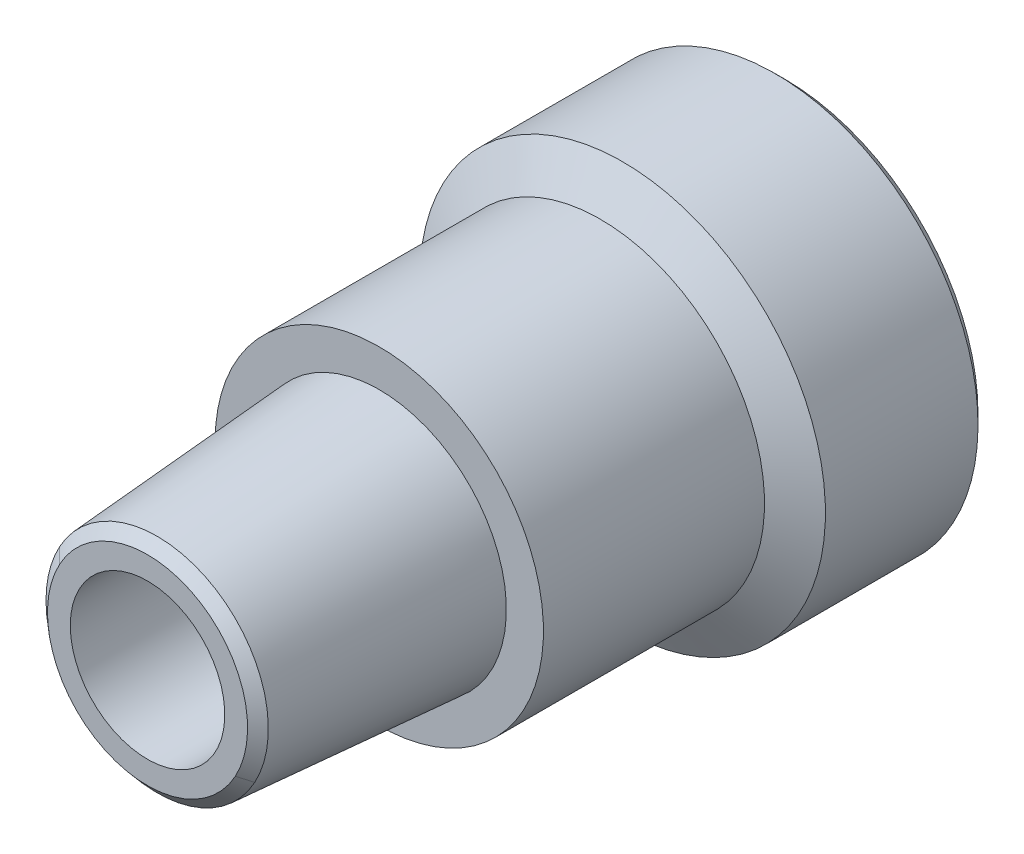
ISO-10303-21;
HEADER;
FILE_DESCRIPTION(('STEP AP214'),'2;1');
FILE_NAME('part.step','',(''),(''),'','','');
FILE_SCHEMA(('AUTOMOTIVE_DESIGN { 1 0 10303 214 1 1 1 1 }'));
ENDSEC;
DATA;
#1=APPLICATION_CONTEXT('core data for automotive mechanical design processes');
#2=APPLICATION_PROTOCOL_DEFINITION('international standard','automotive_design',2000,#1);
#3=PRODUCT_CONTEXT('',#1,'mechanical');
#4=PRODUCT('Part','Part','',(#3));
#5=PRODUCT_RELATED_PRODUCT_CATEGORY('part','',(#4));
#6=PRODUCT_DEFINITION_FORMATION('','',#4);
#7=PRODUCT_DEFINITION_CONTEXT('part definition',#1,'design');
#8=PRODUCT_DEFINITION('design','',#6,#7);
#9=PRODUCT_DEFINITION_SHAPE('','',#8);
#10=(LENGTH_UNIT() NAMED_UNIT(*) SI_UNIT(.MILLI.,.METRE.));
#11=(NAMED_UNIT(*) PLANE_ANGLE_UNIT() SI_UNIT($,.RADIAN.));
#12=(NAMED_UNIT(*) SI_UNIT($,.STERADIAN.) SOLID_ANGLE_UNIT());
#13=UNCERTAINTY_MEASURE_WITH_UNIT(LENGTH_MEASURE(1.E-05),#10,'distance_accuracy_value','');
#14=(GEOMETRIC_REPRESENTATION_CONTEXT(3) GLOBAL_UNCERTAINTY_ASSIGNED_CONTEXT((#13)) GLOBAL_UNIT_ASSIGNED_CONTEXT((#10,
#11,#12)) REPRESENTATION_CONTEXT('',''));
#15=CARTESIAN_POINT('',(0.,0.,0.));
#16=DIRECTION('',(0.,0.,1.));
#17=DIRECTION('',(1.,0.,0.));
#18=AXIS2_PLACEMENT_3D('',#15,#16,#17);
#19=CARTESIAN_POINT('',(0.,0.,8.00000000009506));
#20=DIRECTION('',(0.,0.,-0.999999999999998));
#21=DIRECTION('',(-1.,0.,0.));
#22=AXIS2_PLACEMENT_3D('',#19,#20,#21);
#23=CONICAL_SURFACE('',#22,6.99999999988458,1.04719755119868);
#24=CARTESIAN_POINT('',(0.,0.,9.15470053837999));
#25=DIRECTION('',(0.,0.,-0.999999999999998));
#26=DIRECTION('',(-1.,0.,0.));
#27=AXIS2_PLACEMENT_3D('',#24,#25,#26);
#28=CIRCLE('',#27,5.);
#29=CARTESIAN_POINT('',(-5.00000000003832,0.,9.15470053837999));
#30=VERTEX_POINT('',#29);
#31=EDGE_CURVE('E196',#30,#30,#28,.F.);
#32=CARTESIAN_POINT('',(0.,0.,7.99999999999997));
#33=DIRECTION('',(0.,0.,-0.999999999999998));
#34=DIRECTION('',(-1.,0.,0.));
#35=AXIS2_PLACEMENT_3D('',#32,#33,#34);
#36=CIRCLE('',#35,7.);
#37=CARTESIAN_POINT('',(-7.0000000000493,0.,7.99999999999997));
#38=VERTEX_POINT('',#37);
#39=EDGE_CURVE('E193',#38,#38,#36,.T.);
#40=CARTESIAN_POINT('',(-5.00000000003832,0.,9.15470053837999));
#41=CARTESIAN_POINT('',(-5.02083333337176,0.,9.14267240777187));
#42=CARTESIAN_POINT('',(-5.04166666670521,0.,9.13064427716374));
#43=CARTESIAN_POINT('',(-5.08333333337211,0.,9.10658801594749));
#44=CARTESIAN_POINT('',(-5.10416666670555,0.,9.09455988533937));
#45=CARTESIAN_POINT('',(-5.14583333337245,0.,9.07050362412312));
#46=CARTESIAN_POINT('',(-5.1666666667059,0.,9.05847549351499));
#47=CARTESIAN_POINT('',(-5.20833333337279,0.,9.03441923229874));
#48=CARTESIAN_POINT('',(-5.22916666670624,0.,9.02239110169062));
#49=CARTESIAN_POINT('',(-5.27083333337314,0.,8.99833484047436));
#50=CARTESIAN_POINT('',(-5.29166666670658,0.,8.98630670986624));
#51=CARTESIAN_POINT('',(-5.33333333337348,0.,8.96225044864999));
#52=CARTESIAN_POINT('',(-5.35416666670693,0.,8.95022231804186));
#53=CARTESIAN_POINT('',(-5.39583333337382,0.,8.92616605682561));
#54=CARTESIAN_POINT('',(-5.41666666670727,0.,8.91413792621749));
#55=CARTESIAN_POINT('',(-5.45833333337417,0.,8.89008166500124));
#56=CARTESIAN_POINT('',(-5.47916666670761,0.,8.87805353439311));
#57=CARTESIAN_POINT('',(-5.52083333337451,0.,8.85399727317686));
#58=CARTESIAN_POINT('',(-5.54166666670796,0.,8.84196914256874));
#59=CARTESIAN_POINT('',(-5.58333333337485,0.,8.81791288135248));
#60=CARTESIAN_POINT('',(-5.6041666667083,0.,8.80588475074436));
#61=CARTESIAN_POINT('',(-5.64583333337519,0.,8.78182848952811));
#62=CARTESIAN_POINT('',(-5.66666666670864,0.,8.76980035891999));
#63=CARTESIAN_POINT('',(-5.70833333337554,0.,8.74574409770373));
#64=CARTESIAN_POINT('',(-5.72916666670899,0.,8.73371596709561));
#65=CARTESIAN_POINT('',(-5.77083333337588,0.,8.70965970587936));
#66=CARTESIAN_POINT('',(-5.79166666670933,0.,8.69763157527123));
#67=CARTESIAN_POINT('',(-5.83333333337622,0.,8.67357531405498));
#68=CARTESIAN_POINT('',(-5.85416666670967,0.,8.66154718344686));
#69=CARTESIAN_POINT('',(-5.89583333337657,0.,8.63749092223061));
#70=CARTESIAN_POINT('',(-5.91666666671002,0.,8.62546279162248));
#71=CARTESIAN_POINT('',(-5.95833333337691,0.,8.60140653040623));
#72=CARTESIAN_POINT('',(-5.97916666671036,0.,8.58937839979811));
#73=CARTESIAN_POINT('',(-6.02083333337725,0.,8.56532213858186));
#74=CARTESIAN_POINT('',(-6.0416666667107,0.,8.55329400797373));
#75=CARTESIAN_POINT('',(-6.0833333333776,0.,8.52923774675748));
#76=CARTESIAN_POINT('',(-6.10416666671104,0.,8.51720961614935));
#77=CARTESIAN_POINT('',(-6.14583333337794,0.,8.4931533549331));
#78=CARTESIAN_POINT('',(-6.16666666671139,0.,8.48112522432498));
#79=CARTESIAN_POINT('',(-6.20833333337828,0.,8.45706896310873));
#80=CARTESIAN_POINT('',(-6.22916666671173,0.,8.4450408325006));
#81=CARTESIAN_POINT('',(-6.27083333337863,0.,8.42098457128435));
#82=CARTESIAN_POINT('',(-6.29166666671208,0.,8.40895644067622));
#83=CARTESIAN_POINT('',(-6.33333333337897,0.,8.38490017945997));
#84=CARTESIAN_POINT('',(-6.35416666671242,0.,8.37287204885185));
#85=CARTESIAN_POINT('',(-6.39583333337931,0.,8.3488157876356));
#86=CARTESIAN_POINT('',(-6.41666666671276,0.,8.33678765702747));
#87=CARTESIAN_POINT('',(-6.45833333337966,0.,8.31273139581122));
#88=CARTESIAN_POINT('',(-6.4791666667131,0.,8.3007032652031));
#89=CARTESIAN_POINT('',(-6.52083333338,0.,8.27664700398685));
#90=CARTESIAN_POINT('',(-6.54166666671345,0.,8.26461887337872));
#91=CARTESIAN_POINT('',(-6.58333333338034,0.,8.24056261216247));
#92=CARTESIAN_POINT('',(-6.60416666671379,0.,8.22853448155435));
#93=CARTESIAN_POINT('',(-6.64583333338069,0.,8.20447822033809));
#94=CARTESIAN_POINT('',(-6.66666666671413,0.,8.19245008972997));
#95=CARTESIAN_POINT('',(-6.70833333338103,0.,8.16839382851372));
#96=CARTESIAN_POINT('',(-6.72916666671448,0.,8.15636569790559));
#97=CARTESIAN_POINT('',(-6.77083333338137,0.,8.13230943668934));
#98=CARTESIAN_POINT('',(-6.79166666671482,0.,8.12028130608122));
#99=CARTESIAN_POINT('',(-6.83333333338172,0.,8.09622504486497));
#100=CARTESIAN_POINT('',(-6.85416666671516,0.,8.08419691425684));
#101=CARTESIAN_POINT('',(-6.89583333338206,0.,8.06014065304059));
#102=CARTESIAN_POINT('',(-6.91666666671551,0.,8.04811252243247));
#103=CARTESIAN_POINT('',(-6.9583333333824,0.,8.02405626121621));
#104=CARTESIAN_POINT('',(-6.97916666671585,0.,8.01202813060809));
#105=CARTESIAN_POINT('',(-7.0000000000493,0.,7.99999999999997));
#106=B_SPLINE_CURVE_WITH_KNOTS('',3,(#40,#41,#42,#43,#44,#45,#46,#47,#48,#49,#50,#51,#52,#53,
#54,#55,#56,#57,#58,#59,#60,#61,#62,#63,#64,#65,#66,#67,#68,#69,#70,#71,#72,#73,#74,#75,#76,#77,
#78,#79,#80,#81,#82,#83,#84,#85,#86,#87,#88,#89,#90,#91,#92,#93,#94,#95,#96,#97,#98,#99,#100,
#101,#102,#103,#104,#105),.UNSPECIFIED.,.F.,.F.,(4,2,2,2,2,2,2,2,2,2,2,2,2,2,2,2,2,2,2,2,2,2,2,
2,2,2,2,2,2,2,2,2,4),(0.,0.0721687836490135,0.144337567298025,0.216506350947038,
0.288675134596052,0.360843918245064,0.433012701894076,0.505181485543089,0.577350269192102,
0.649519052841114,0.721687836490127,0.793856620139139,0.866025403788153,0.938194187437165,
1.01036297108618,1.08253175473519,1.1547005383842,1.22686932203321,1.29903810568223,
1.37120688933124,1.44337567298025,1.51554445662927,1.58771324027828,1.65988202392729,
1.7320508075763,1.80421959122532,1.87638837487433,1.94855715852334,2.02072594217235,
2.09289472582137,2.16506350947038,2.23723229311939,2.3094010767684),.UNSPECIFIED.);
#107=EDGE_CURVE('BSEAM16',#30,#38,#106,.T.);
#108=ORIENTED_EDGE('',*,*,#31,.T.);
#109=ORIENTED_EDGE('',*,*,#39,.T.);
#110=ORIENTED_EDGE('',*,*,#107,.T.);
#111=ORIENTED_EDGE('',*,*,#107,.F.);
#112=EDGE_LOOP('',(#108,#110,#109,#111));
#113=FACE_BOUND('',#112,.T.);
#114=ADVANCED_FACE('F16',(#113),#23,.F.);
#115=CARTESIAN_POINT('',(0.,0.,27.7499999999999));
#116=DIRECTION('',(0.,0.,-0.999999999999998));
#117=DIRECTION('',(-1.,0.,0.));
#118=AXIS2_PLACEMENT_3D('',#115,#116,#117);
#119=CYLINDRICAL_SURFACE('',#118,7.);
#120=CARTESIAN_POINT('',(0.,0.,7.00000000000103));
#121=DIRECTION('',(0.,0.,-0.999999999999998));
#122=DIRECTION('',(-0.877582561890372,0.479425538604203,0.));
#123=AXIS2_PLACEMENT_3D('',#120,#121,#122);
#124=CIRCLE('',#123,6.999999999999);
#125=CARTESIAN_POINT('',(-7.00000000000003,0.,7.00000000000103));
#126=VERTEX_POINT('',#125);
#127=EDGE_CURVE('E199',#126,#126,#124,.T.);
#128=CARTESIAN_POINT('',(-7.00000000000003,0.,7.99999999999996));
#129=CARTESIAN_POINT('',(-7.00000000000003,0.,7.98958333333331));
#130=CARTESIAN_POINT('',(-7.00000000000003,0.,7.97916666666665));
#131=CARTESIAN_POINT('',(-7.00000000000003,0.,7.95833333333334));
#132=CARTESIAN_POINT('',(-7.00000000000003,0.,7.94791666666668));
#133=CARTESIAN_POINT('',(-7.00000000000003,0.,7.92708333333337));
#134=CARTESIAN_POINT('',(-7.00000000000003,0.,7.91666666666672));
#135=CARTESIAN_POINT('',(-7.00000000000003,0.,7.89583333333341));
#136=CARTESIAN_POINT('',(-7.00000000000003,0.,7.88541666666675));
#137=CARTESIAN_POINT('',(-7.00000000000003,0.,7.86458333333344));
#138=CARTESIAN_POINT('',(-7.00000000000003,0.,7.85416666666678));
#139=CARTESIAN_POINT('',(-7.00000000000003,0.,7.83333333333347));
#140=CARTESIAN_POINT('',(-7.00000000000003,0.,7.82291666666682));
#141=CARTESIAN_POINT('',(-7.00000000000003,0.,7.80208333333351));
#142=CARTESIAN_POINT('',(-7.00000000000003,0.,7.79166666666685));
#143=CARTESIAN_POINT('',(-7.00000000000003,0.,7.77083333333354));
#144=CARTESIAN_POINT('',(-7.00000000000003,0.,7.76041666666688));
#145=CARTESIAN_POINT('',(-7.00000000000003,0.,7.73958333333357));
#146=CARTESIAN_POINT('',(-7.00000000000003,0.,7.72916666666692));
#147=CARTESIAN_POINT('',(-7.00000000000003,0.,7.70833333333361));
#148=CARTESIAN_POINT('',(-7.00000000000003,0.,7.69791666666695));
#149=CARTESIAN_POINT('',(-7.00000000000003,0.,7.67708333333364));
#150=CARTESIAN_POINT('',(-7.00000000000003,0.,7.66666666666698));
#151=CARTESIAN_POINT('',(-7.00000000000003,0.,7.64583333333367));
#152=CARTESIAN_POINT('',(-7.00000000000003,0.,7.63541666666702));
#153=CARTESIAN_POINT('',(-7.00000000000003,0.,7.61458333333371));
#154=CARTESIAN_POINT('',(-7.00000000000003,0.,7.60416666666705));
#155=CARTESIAN_POINT('',(-7.00000000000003,0.,7.58333333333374));
#156=CARTESIAN_POINT('',(-7.00000000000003,0.,7.57291666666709));
#157=CARTESIAN_POINT('',(-7.00000000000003,0.,7.55208333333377));
#158=CARTESIAN_POINT('',(-7.00000000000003,0.,7.54166666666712));
#159=CARTESIAN_POINT('',(-7.00000000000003,0.,7.52083333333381));
#160=CARTESIAN_POINT('',(-7.00000000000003,0.,7.51041666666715));
#161=CARTESIAN_POINT('',(-7.00000000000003,0.,7.48958333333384));
#162=CARTESIAN_POINT('',(-7.00000000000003,0.,7.47916666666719));
#163=CARTESIAN_POINT('',(-7.00000000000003,0.,7.45833333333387));
#164=CARTESIAN_POINT('',(-7.00000000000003,0.,7.44791666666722));
#165=CARTESIAN_POINT('',(-7.00000000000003,0.,7.42708333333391));
#166=CARTESIAN_POINT('',(-7.00000000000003,0.,7.41666666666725));
#167=CARTESIAN_POINT('',(-7.00000000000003,0.,7.39583333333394));
#168=CARTESIAN_POINT('',(-7.00000000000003,0.,7.38541666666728));
#169=CARTESIAN_POINT('',(-7.00000000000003,0.,7.36458333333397));
#170=CARTESIAN_POINT('',(-7.00000000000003,0.,7.35416666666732));
#171=CARTESIAN_POINT('',(-7.00000000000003,0.,7.33333333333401));
#172=CARTESIAN_POINT('',(-7.00000000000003,0.,7.32291666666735));
#173=CARTESIAN_POINT('',(-7.00000000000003,0.,7.30208333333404));
#174=CARTESIAN_POINT('',(-7.00000000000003,0.,7.29166666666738));
#175=CARTESIAN_POINT('',(-7.00000000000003,0.,7.27083333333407));
#176=CARTESIAN_POINT('',(-7.00000000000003,0.,7.26041666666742));
#177=CARTESIAN_POINT('',(-7.00000000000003,0.,7.23958333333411));
#178=CARTESIAN_POINT('',(-7.00000000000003,0.,7.22916666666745));
#179=CARTESIAN_POINT('',(-7.00000000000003,0.,7.20833333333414));
#180=CARTESIAN_POINT('',(-7.00000000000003,0.,7.19791666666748));
#181=CARTESIAN_POINT('',(-7.00000000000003,0.,7.17708333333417));
#182=CARTESIAN_POINT('',(-7.00000000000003,0.,7.16666666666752));
#183=CARTESIAN_POINT('',(-7.00000000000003,0.,7.14583333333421));
#184=CARTESIAN_POINT('',(-7.00000000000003,0.,7.13541666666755));
#185=CARTESIAN_POINT('',(-7.00000000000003,0.,7.11458333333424));
#186=CARTESIAN_POINT('',(-7.00000000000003,0.,7.10416666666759));
#187=CARTESIAN_POINT('',(-7.00000000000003,0.,7.08333333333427));
#188=CARTESIAN_POINT('',(-7.00000000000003,0.,7.07291666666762));
#189=CARTESIAN_POINT('',(-7.00000000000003,0.,7.05208333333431));
#190=CARTESIAN_POINT('',(-7.00000000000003,0.,7.04166666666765));
#191=CARTESIAN_POINT('',(-7.00000000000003,0.,7.02083333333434));
#192=CARTESIAN_POINT('',(-7.00000000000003,0.,7.01041666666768));
#193=CARTESIAN_POINT('',(-7.00000000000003,0.,7.00000000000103));
#194=B_SPLINE_CURVE_WITH_KNOTS('',3,(#128,#129,#130,#131,#132,#133,#134,#135,#136,#137,#138,
#139,#140,#141,#142,#143,#144,#145,#146,#147,#148,#149,#150,#151,#152,#153,#154,#155,#156,#157,
#158,#159,#160,#161,#162,#163,#164,#165,#166,#167,#168,#169,#170,#171,#172,#173,#174,#175,#176,
#177,#178,#179,#180,#181,#182,#183,#184,#185,#186,#187,#188,#189,#190,#191,#192,#193),
.UNSPECIFIED.,.F.,.F.,(4,2,2,2,2,2,2,2,2,2,2,2,2,2,2,2,2,2,2,2,2,2,2,2,2,2,2,2,2,2,2,2,4),(0.,
0.0312499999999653,0.0624999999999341,0.0937499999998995,0.124999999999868,0.156249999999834,
0.187499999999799,0.218749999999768,0.249999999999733,0.281249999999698,0.312499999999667,
0.343749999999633,0.374999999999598,0.406249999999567,0.437499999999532,0.468749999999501,
0.499999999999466,0.531249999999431,0.5624999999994,0.593749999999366,0.624999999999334,
0.6562499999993,0.687499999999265,0.718749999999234,0.749999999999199,0.781249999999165,
0.812499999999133,0.843749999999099,0.874999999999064,0.906249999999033,0.937499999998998,
0.968749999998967,0.999999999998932),.UNSPECIFIED.);
#195=EDGE_CURVE('BSEAM571',#38,#126,#194,.T.);
#196=ORIENTED_EDGE('',*,*,#39,.F.);
#197=ORIENTED_EDGE('',*,*,#127,.T.);
#198=ORIENTED_EDGE('',*,*,#195,.T.);
#199=ORIENTED_EDGE('',*,*,#195,.F.);
#200=EDGE_LOOP('',(#196,#198,#197,#199));
#201=FACE_BOUND('',#200,.T.);
#202=ADVANCED_FACE('F571',(#201),#119,.F.);
#203=CARTESIAN_POINT('',(0.,0.,27.7499999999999));
#204=DIRECTION('',(0.,0.,-0.999999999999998));
#205=DIRECTION('',(-1.,0.,0.));
#206=AXIS2_PLACEMENT_3D('',#203,#204,#205);
#207=CYLINDRICAL_SURFACE('',#206,5.);
#208=CARTESIAN_POINT('',(0.,0.,19.6547005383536));
#209=DIRECTION('',(0.,0.,-0.999999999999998));
#210=DIRECTION('',(-0.87758256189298,0.47942553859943,0.));
#211=AXIS2_PLACEMENT_3D('',#208,#209,#210);
#212=CIRCLE('',#211,4.9999999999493);
#213=CARTESIAN_POINT('',(-5.00000000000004,0.,19.6547005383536));
#214=VERTEX_POINT('',#213);
#215=EDGE_CURVE('E202',#214,#214,#212,.F.);
#216=CARTESIAN_POINT('',(-5.00000000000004,0.,19.6547005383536));
#217=CARTESIAN_POINT('',(-5.00000000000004,0.,19.5453255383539));
#218=CARTESIAN_POINT('',(-5.00000000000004,0.,19.4359505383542));
#219=CARTESIAN_POINT('',(-5.00000000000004,0.,19.2172005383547));
#220=CARTESIAN_POINT('',(-5.00000000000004,0.,19.107825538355));
#221=CARTESIAN_POINT('',(-5.00000000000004,0.,18.8890755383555));
#222=CARTESIAN_POINT('',(-5.00000000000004,0.,18.7797005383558));
#223=CARTESIAN_POINT('',(-5.00000000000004,0.,18.5609505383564));
#224=CARTESIAN_POINT('',(-5.00000000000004,0.,18.4515755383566));
#225=CARTESIAN_POINT('',(-5.00000000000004,0.,18.2328255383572));
#226=CARTESIAN_POINT('',(-5.00000000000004,0.,18.1234505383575));
#227=CARTESIAN_POINT('',(-5.00000000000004,0.,17.904700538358));
#228=CARTESIAN_POINT('',(-5.00000000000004,0.,17.7953255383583));
#229=CARTESIAN_POINT('',(-5.00000000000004,0.,17.5765755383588));
#230=CARTESIAN_POINT('',(-5.00000000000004,0.,17.4672005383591));
#231=CARTESIAN_POINT('',(-5.00000000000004,0.,17.2484505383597));
#232=CARTESIAN_POINT('',(-5.00000000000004,0.,17.1390755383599));
#233=CARTESIAN_POINT('',(-5.00000000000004,0.,16.9203255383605));
#234=CARTESIAN_POINT('',(-5.00000000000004,0.,16.8109505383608));
#235=CARTESIAN_POINT('',(-5.00000000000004,0.,16.5922005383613));
#236=CARTESIAN_POINT('',(-5.00000000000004,0.,16.4828255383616));
#237=CARTESIAN_POINT('',(-5.00000000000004,0.,16.2640755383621));
#238=CARTESIAN_POINT('',(-5.00000000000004,0.,16.1547005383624));
#239=CARTESIAN_POINT('',(-5.00000000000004,0.,15.935950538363));
#240=CARTESIAN_POINT('',(-5.00000000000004,0.,15.8265755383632));
#241=CARTESIAN_POINT('',(-5.00000000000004,0.,15.6078255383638));
#242=CARTESIAN_POINT('',(-5.00000000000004,0.,15.4984505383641));
#243=CARTESIAN_POINT('',(-5.00000000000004,0.,15.2797005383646));
#244=CARTESIAN_POINT('',(-5.00000000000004,0.,15.1703255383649));
#245=CARTESIAN_POINT('',(-5.00000000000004,0.,14.9515755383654));
#246=CARTESIAN_POINT('',(-5.00000000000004,0.,14.8422005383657));
#247=CARTESIAN_POINT('',(-5.00000000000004,0.,14.6234505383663));
#248=CARTESIAN_POINT('',(-5.00000000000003,0.,14.5140755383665));
#249=CARTESIAN_POINT('',(-5.00000000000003,0.,14.2953255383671));
#250=CARTESIAN_POINT('',(-5.00000000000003,0.,14.1859505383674));
#251=CARTESIAN_POINT('',(-5.00000000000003,0.,13.9672005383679));
#252=CARTESIAN_POINT('',(-5.00000000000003,0.,13.8578255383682));
#253=CARTESIAN_POINT('',(-5.00000000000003,0.,13.6390755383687));
#254=CARTESIAN_POINT('',(-5.00000000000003,0.,13.529700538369));
#255=CARTESIAN_POINT('',(-5.00000000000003,0.,13.3109505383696));
#256=CARTESIAN_POINT('',(-5.00000000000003,0.,13.2015755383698));
#257=CARTESIAN_POINT('',(-5.00000000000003,0.,12.9828255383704));
#258=CARTESIAN_POINT('',(-5.00000000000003,0.,12.8734505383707));
#259=CARTESIAN_POINT('',(-5.00000000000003,0.,12.6547005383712));
#260=CARTESIAN_POINT('',(-5.00000000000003,0.,12.5453255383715));
#261=CARTESIAN_POINT('',(-5.00000000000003,0.,12.326575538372));
#262=CARTESIAN_POINT('',(-5.00000000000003,0.,12.2172005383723));
#263=CARTESIAN_POINT('',(-5.00000000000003,0.,11.9984505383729));
#264=CARTESIAN_POINT('',(-5.00000000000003,0.,11.8890755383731));
#265=CARTESIAN_POINT('',(-5.00000000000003,0.,11.6703255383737));
#266=CARTESIAN_POINT('',(-5.00000000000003,0.,11.560950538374));
#267=CARTESIAN_POINT('',(-5.00000000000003,0.,11.3422005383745));
#268=CARTESIAN_POINT('',(-5.00000000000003,0.,11.2328255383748));
#269=CARTESIAN_POINT('',(-5.00000000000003,0.,11.0140755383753));
#270=CARTESIAN_POINT('',(-5.00000000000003,0.,10.9047005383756));
#271=CARTESIAN_POINT('',(-5.00000000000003,0.,10.6859505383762));
#272=CARTESIAN_POINT('',(-5.00000000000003,0.,10.5765755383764));
#273=CARTESIAN_POINT('',(-5.00000000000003,0.,10.357825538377));
#274=CARTESIAN_POINT('',(-5.00000000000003,0.,10.2484505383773));
#275=CARTESIAN_POINT('',(-5.00000000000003,0.,10.0297005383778));
#276=CARTESIAN_POINT('',(-5.00000000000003,0.,9.92032553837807));
#277=CARTESIAN_POINT('',(-5.00000000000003,0.,9.70157553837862));
#278=CARTESIAN_POINT('',(-5.00000000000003,0.,9.5922005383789));
#279=CARTESIAN_POINT('',(-5.00000000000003,0.,9.37345053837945));
#280=CARTESIAN_POINT('',(-5.00000000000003,0.,9.26407553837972));
#281=CARTESIAN_POINT('',(-5.00000000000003,0.,9.15470053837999));
#282=B_SPLINE_CURVE_WITH_KNOTS('',3,(#216,#217,#218,#219,#220,#221,#222,#223,#224,#225,#226,
#227,#228,#229,#230,#231,#232,#233,#234,#235,#236,#237,#238,#239,#240,#241,#242,#243,#244,#245,
#246,#247,#248,#249,#250,#251,#252,#253,#254,#255,#256,#257,#258,#259,#260,#261,#262,#263,#264,
#265,#266,#267,#268,#269,#270,#271,#272,#273,#274,#275,#276,#277,#278,#279,#280,#281),
.UNSPECIFIED.,.F.,.F.,(4,2,2,2,2,2,2,2,2,2,2,2,2,2,2,2,2,2,2,2,2,2,2,2,2,2,2,2,2,2,2,2,4),(0.,
0.328124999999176,0.656249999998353,0.984374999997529,1.31249999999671,1.64062499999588,
1.96874999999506,2.29687499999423,2.62499999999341,2.95312499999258,3.28124999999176,
3.60937499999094,3.93749999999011,4.26562499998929,4.59374999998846,4.92187499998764,
5.24999999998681,5.57812499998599,5.90624999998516,6.23437499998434,6.56249999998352,
6.89062499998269,7.21874999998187,7.54687499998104,7.87499999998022,8.2031249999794,
8.53124999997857,8.85937499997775,9.18749999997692,9.5156249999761,9.84374999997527,
10.1718749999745,10.4999999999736),.UNSPECIFIED.);
#283=EDGE_CURVE('BSEAM567',#214,#30,#282,.T.);
#284=ORIENTED_EDGE('',*,*,#215,.T.);
#285=ORIENTED_EDGE('',*,*,#31,.F.);
#286=ORIENTED_EDGE('',*,*,#283,.T.);
#287=ORIENTED_EDGE('',*,*,#283,.F.);
#288=EDGE_LOOP('',(#284,#286,#285,#287));
#289=FACE_BOUND('',#288,.T.);
#290=ADVANCED_FACE('F567',(#289),#207,.F.);
#291=CARTESIAN_POINT('',(0.,0.,5.00000000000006));
#292=DIRECTION('',(0.,0.,-0.999999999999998));
#293=DIRECTION('',(-1.,0.,0.));
#294=AXIS2_PLACEMENT_3D('',#291,#292,#293);
#295=CONICAL_SURFACE('',#294,8.99999999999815,0.785398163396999);
#296=CARTESIAN_POINT('',(0.,0.,4.99999999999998));
#297=DIRECTION('',(0.,0.,-0.999999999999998));
#298=DIRECTION('',(-1.,0.,0.));
#299=AXIS2_PLACEMENT_3D('',#296,#297,#298);
#300=CIRCLE('',#299,9.);
#301=CARTESIAN_POINT('',(-8.99999999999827,0.,4.99999999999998));
#302=VERTEX_POINT('',#301);
#303=EDGE_CURVE('E205',#302,#302,#300,.T.);
#304=CARTESIAN_POINT('',(-6.99999999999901,0.,7.00000000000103));
#305=CARTESIAN_POINT('',(-7.02083333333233,0.,6.97916666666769));
#306=CARTESIAN_POINT('',(-7.04166666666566,0.,6.95833333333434));
#307=CARTESIAN_POINT('',(-7.08333333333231,0.,6.91666666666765));
#308=CARTESIAN_POINT('',(-7.10416666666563,0.,6.89583333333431));
#309=CARTESIAN_POINT('',(-7.14583333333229,0.,6.85416666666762));
#310=CARTESIAN_POINT('',(-7.16666666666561,0.,6.83333333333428));
#311=CARTESIAN_POINT('',(-7.20833333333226,0.,6.79166666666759));
#312=CARTESIAN_POINT('',(-7.22916666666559,0.,6.77083333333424));
#313=CARTESIAN_POINT('',(-7.27083333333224,0.,6.72916666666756));
#314=CARTESIAN_POINT('',(-7.29166666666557,0.,6.70833333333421));
#315=CARTESIAN_POINT('',(-7.33333333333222,0.,6.66666666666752));
#316=CARTESIAN_POINT('',(-7.35416666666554,0.,6.64583333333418));
#317=CARTESIAN_POINT('',(-7.39583333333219,0.,6.60416666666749));
#318=CARTESIAN_POINT('',(-7.41666666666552,0.,6.58333333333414));
#319=CARTESIAN_POINT('',(-7.45833333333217,0.,6.54166666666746));
#320=CARTESIAN_POINT('',(-7.4791666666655,0.,6.52083333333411));
#321=CARTESIAN_POINT('',(-7.52083333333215,0.,6.47916666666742));
#322=CARTESIAN_POINT('',(-7.54166666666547,0.,6.45833333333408));
#323=CARTESIAN_POINT('',(-7.58333333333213,0.,6.41666666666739));
#324=CARTESIAN_POINT('',(-7.60416666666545,0.,6.39583333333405));
#325=CARTESIAN_POINT('',(-7.6458333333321,0.,6.35416666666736));
#326=CARTESIAN_POINT('',(-7.66666666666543,0.,6.33333333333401));
#327=CARTESIAN_POINT('',(-7.70833333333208,0.,6.29166666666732));
#328=CARTESIAN_POINT('',(-7.7291666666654,0.,6.27083333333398));
#329=CARTESIAN_POINT('',(-7.77083333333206,0.,6.22916666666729));
#330=CARTESIAN_POINT('',(-7.79166666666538,0.,6.20833333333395));
#331=CARTESIAN_POINT('',(-7.83333333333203,0.,6.16666666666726));
#332=CARTESIAN_POINT('',(-7.85416666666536,0.,6.14583333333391));
#333=CARTESIAN_POINT('',(-7.89583333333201,0.,6.10416666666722));
#334=CARTESIAN_POINT('',(-7.91666666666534,0.,6.08333333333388));
#335=CARTESIAN_POINT('',(-7.95833333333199,0.,6.04166666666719));
#336=CARTESIAN_POINT('',(-7.97916666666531,0.,6.02083333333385));
#337=CARTESIAN_POINT('',(-8.02083333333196,0.,5.97916666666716));
#338=CARTESIAN_POINT('',(-8.04166666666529,0.,5.95833333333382));
#339=CARTESIAN_POINT('',(-8.08333333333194,0.,5.91666666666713));
#340=CARTESIAN_POINT('',(-8.10416666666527,0.,5.89583333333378));
#341=CARTESIAN_POINT('',(-8.14583333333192,0.,5.85416666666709));
#342=CARTESIAN_POINT('',(-8.16666666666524,0.,5.83333333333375));
#343=CARTESIAN_POINT('',(-8.2083333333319,0.,5.79166666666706));
#344=CARTESIAN_POINT('',(-8.22916666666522,0.,5.77083333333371));
#345=CARTESIAN_POINT('',(-8.27083333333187,0.,5.72916666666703));
#346=CARTESIAN_POINT('',(-8.2916666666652,0.,5.70833333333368));
#347=CARTESIAN_POINT('',(-8.33333333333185,0.,5.66666666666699));
#348=CARTESIAN_POINT('',(-8.35416666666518,0.,5.64583333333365));
#349=CARTESIAN_POINT('',(-8.39583333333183,0.,5.60416666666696));
#350=CARTESIAN_POINT('',(-8.41666666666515,0.,5.58333333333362));
#351=CARTESIAN_POINT('',(-8.4583333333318,0.,5.54166666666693));
#352=CARTESIAN_POINT('',(-8.47916666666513,0.,5.52083333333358));
#353=CARTESIAN_POINT('',(-8.52083333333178,0.,5.4791666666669));
#354=CARTESIAN_POINT('',(-8.54166666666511,0.,5.45833333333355));
#355=CARTESIAN_POINT('',(-8.58333333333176,0.,5.41666666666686));
#356=CARTESIAN_POINT('',(-8.60416666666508,0.,5.39583333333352));
#357=CARTESIAN_POINT('',(-8.64583333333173,0.,5.35416666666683));
#358=CARTESIAN_POINT('',(-8.66666666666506,0.,5.33333333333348));
#359=CARTESIAN_POINT('',(-8.70833333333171,0.,5.2916666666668));
#360=CARTESIAN_POINT('',(-8.72916666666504,0.,5.27083333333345));
#361=CARTESIAN_POINT('',(-8.77083333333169,0.,5.22916666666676));
#362=CARTESIAN_POINT('',(-8.79166666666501,0.,5.20833333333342));
#363=CARTESIAN_POINT('',(-8.83333333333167,0.,5.16666666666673));
#364=CARTESIAN_POINT('',(-8.85416666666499,0.,5.14583333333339));
#365=CARTESIAN_POINT('',(-8.89583333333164,0.,5.1041666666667));
#366=CARTESIAN_POINT('',(-8.91666666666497,0.,5.08333333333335));
#367=CARTESIAN_POINT('',(-8.95833333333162,0.,5.04166666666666));
#368=CARTESIAN_POINT('',(-8.97916666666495,0.,5.02083333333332));
#369=CARTESIAN_POINT('',(-8.99999999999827,0.,4.99999999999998));
#370=B_SPLINE_CURVE_WITH_KNOTS('',3,(#304,#305,#306,#307,#308,#309,#310,#311,#312,#313,#314,
#315,#316,#317,#318,#319,#320,#321,#322,#323,#324,#325,#326,#327,#328,#329,#330,#331,#332,#333,
#334,#335,#336,#337,#338,#339,#340,#341,#342,#343,#344,#345,#346,#347,#348,#349,#350,#351,#352,
#353,#354,#355,#356,#357,#358,#359,#360,#361,#362,#363,#364,#365,#366,#367,#368,#369),
.UNSPECIFIED.,.F.,.F.,(4,2,2,2,2,2,2,2,2,2,2,2,2,2,2,2,2,2,2,2,2,2,2,2,2,2,2,2,2,2,2,2,4),(0.,
0.0883883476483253,0.176776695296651,0.265165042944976,0.353553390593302,0.441941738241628,
0.530330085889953,0.618718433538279,0.707106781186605,0.79549512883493,0.883883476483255,
0.972271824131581,1.06066017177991,1.14904851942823,1.23743686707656,1.32582521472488,
1.41421356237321,1.50260191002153,1.59099025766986,1.67937860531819,1.76776695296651,
1.85615530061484,1.94454364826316,2.03293199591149,2.12132034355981,2.20970869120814,
2.29809703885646,2.38648538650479,2.47487373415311,2.56326208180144,2.65165042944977,
2.74003877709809,2.82842712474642),.UNSPECIFIED.);
#371=EDGE_CURVE('BSEAM563',#126,#302,#370,.T.);
#372=ORIENTED_EDGE('',*,*,#127,.F.);
#373=ORIENTED_EDGE('',*,*,#303,.T.);
#374=ORIENTED_EDGE('',*,*,#371,.T.);
#375=ORIENTED_EDGE('',*,*,#371,.F.);
#376=EDGE_LOOP('',(#372,#374,#373,#375));
#377=FACE_BOUND('',#376,.T.);
#378=ADVANCED_FACE('F563',(#377),#295,.F.);
#379=CARTESIAN_POINT('',(0.,0.,19.6547005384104));
#380=DIRECTION('',(0.,0.,-0.999999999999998));
#381=DIRECTION('',(-1.,0.,0.));
#382=AXIS2_PLACEMENT_3D('',#379,#380,#381);
#383=CONICAL_SURFACE('',#382,4.99999999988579,0.78539816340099);
#384=CARTESIAN_POINT('',(0.,0.,20.7999999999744));
#385=DIRECTION('',(0.,0.,-0.999999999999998));
#386=DIRECTION('',(-1.,0.,0.));
#387=AXIS2_PLACEMENT_3D('',#384,#385,#386);
#388=CIRCLE('',#387,3.8547005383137);
#389=CARTESIAN_POINT('',(-3.85470053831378,0.,20.7999999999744));
#390=VERTEX_POINT('',#389);
#391=EDGE_CURVE('E20',#390,#390,#388,.F.);
#392=CARTESIAN_POINT('',(-4.99999999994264,0.,19.6547005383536));
#393=CARTESIAN_POINT('',(-4.98806979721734,0.,19.6666307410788));
#394=CARTESIAN_POINT('',(-4.97613959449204,0.,19.6785609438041));
#395=CARTESIAN_POINT('',(-4.95227918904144,0.,19.7024213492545));
#396=CARTESIAN_POINT('',(-4.94034898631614,0.,19.7143515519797));
#397=CARTESIAN_POINT('',(-4.91648858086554,0.,19.7382119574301));
#398=CARTESIAN_POINT('',(-4.90455837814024,0.,19.7501421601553));
#399=CARTESIAN_POINT('',(-4.88069797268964,0.,19.7740025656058));
#400=CARTESIAN_POINT('',(-4.86876776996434,0.,19.785932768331));
#401=CARTESIAN_POINT('',(-4.84490736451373,0.,19.8097931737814));
#402=CARTESIAN_POINT('',(-4.83297716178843,0.,19.8217233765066));
#403=CARTESIAN_POINT('',(-4.80911675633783,0.,19.8455837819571));
#404=CARTESIAN_POINT('',(-4.79718655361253,0.,19.8575139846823));
#405=CARTESIAN_POINT('',(-4.77332614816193,0.,19.8813743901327));
#406=CARTESIAN_POINT('',(-4.76139594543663,0.,19.8933045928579));
#407=CARTESIAN_POINT('',(-4.73753553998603,0.,19.9171649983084));
#408=CARTESIAN_POINT('',(-4.72560533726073,0.,19.9290952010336));
#409=CARTESIAN_POINT('',(-4.70174493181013,0.,19.952955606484));
#410=CARTESIAN_POINT('',(-4.68981472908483,0.,19.9648858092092));
#411=CARTESIAN_POINT('',(-4.66595432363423,0.,19.9887462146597));
#412=CARTESIAN_POINT('',(-4.65402412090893,0.,20.0006764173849));
#413=CARTESIAN_POINT('',(-4.63016371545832,0.,20.0245368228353));
#414=CARTESIAN_POINT('',(-4.61823351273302,0.,20.0364670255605));
#415=CARTESIAN_POINT('',(-4.59437310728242,0.,20.060327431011));
#416=CARTESIAN_POINT('',(-4.58244290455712,0.,20.0722576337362));
#417=CARTESIAN_POINT('',(-4.55858249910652,0.,20.0961180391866));
#418=CARTESIAN_POINT('',(-4.54665229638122,0.,20.1080482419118));
#419=CARTESIAN_POINT('',(-4.52279189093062,0.,20.1319086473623));
#420=CARTESIAN_POINT('',(-4.51086168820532,0.,20.1438388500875));
#421=CARTESIAN_POINT('',(-4.48700128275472,0.,20.1676992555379));
#422=CARTESIAN_POINT('',(-4.47507108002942,0.,20.1796294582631));
#423=CARTESIAN_POINT('',(-4.45121067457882,0.,20.2034898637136));
#424=CARTESIAN_POINT('',(-4.43928047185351,0.,20.2154200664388));
#425=CARTESIAN_POINT('',(-4.41542006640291,0.,20.2392804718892));
#426=CARTESIAN_POINT('',(-4.40348986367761,0.,20.2512106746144));
#427=CARTESIAN_POINT('',(-4.37962945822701,0.,20.2750710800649));
#428=CARTESIAN_POINT('',(-4.36769925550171,0.,20.2870012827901));
#429=CARTESIAN_POINT('',(-4.34383885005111,0.,20.3108616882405));
#430=CARTESIAN_POINT('',(-4.33190864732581,0.,20.3227918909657));
#431=CARTESIAN_POINT('',(-4.30804824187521,0.,20.3466522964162));
#432=CARTESIAN_POINT('',(-4.29611803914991,0.,20.3585824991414));
#433=CARTESIAN_POINT('',(-4.27225763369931,0.,20.3824429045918));
#434=CARTESIAN_POINT('',(-4.26032743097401,0.,20.394373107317));
#435=CARTESIAN_POINT('',(-4.2364670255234,0.,20.4182335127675));
#436=CARTESIAN_POINT('',(-4.2245368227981,0.,20.4301637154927));
#437=CARTESIAN_POINT('',(-4.2006764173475,0.,20.4540241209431));
#438=CARTESIAN_POINT('',(-4.1887462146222,0.,20.4659543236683));
#439=CARTESIAN_POINT('',(-4.1648858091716,0.,20.4898147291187));
#440=CARTESIAN_POINT('',(-4.1529556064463,0.,20.501744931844));
#441=CARTESIAN_POINT('',(-4.1290952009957,0.,20.5256053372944));
#442=CARTESIAN_POINT('',(-4.1171649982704,0.,20.5375355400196));
#443=CARTESIAN_POINT('',(-4.0933045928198,0.,20.56139594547));
#444=CARTESIAN_POINT('',(-4.0813743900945,0.,20.5733261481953));
#445=CARTESIAN_POINT('',(-4.0575139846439,0.,20.5971865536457));
#446=CARTESIAN_POINT('',(-4.04558378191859,0.,20.6091167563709));
#447=CARTESIAN_POINT('',(-4.02172337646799,0.,20.6329771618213));
#448=CARTESIAN_POINT('',(-4.00979317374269,0.,20.6449073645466));
#449=CARTESIAN_POINT('',(-3.98593276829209,0.,20.668767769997));
#450=CARTESIAN_POINT('',(-3.97400256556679,0.,20.6806979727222));
#451=CARTESIAN_POINT('',(-3.95014216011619,0.,20.7045583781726));
#452=CARTESIAN_POINT('',(-3.93821195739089,0.,20.7164885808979));
#453=CARTESIAN_POINT('',(-3.91435155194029,0.,20.7403489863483));
#454=CARTESIAN_POINT('',(-3.90242134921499,0.,20.7522791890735));
#455=CARTESIAN_POINT('',(-3.87856094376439,0.,20.7761395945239));
#456=CARTESIAN_POINT('',(-3.86663074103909,0.,20.7880697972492));
#457=CARTESIAN_POINT('',(-3.85470053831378,0.,20.7999999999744));
#458=B_SPLINE_CURVE_WITH_KNOTS('',3,(#392,#393,#394,#395,#396,#397,#398,#399,#400,#401,#402,
#403,#404,#405,#406,#407,#408,#409,#410,#411,#412,#413,#414,#415,#416,#417,#418,#419,#420,#421,
#422,#423,#424,#425,#426,#427,#428,#429,#430,#431,#432,#433,#434,#435,#436,#437,#438,#439,#440,
#441,#442,#443,#444,#445,#446,#447,#448,#449,#450,#451,#452,#453,#454,#455,#456,#457),
.UNSPECIFIED.,.F.,.F.,(4,2,2,2,2,2,2,2,2,2,2,2,2,2,2,2,2,2,2,2,2,2,2,2,2,2,2,2,2,2,2,2,4),(0.,
0.050615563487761,0.101231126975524,0.151846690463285,0.202462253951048,0.253077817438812,
0.303693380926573,0.354308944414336,0.404924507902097,0.45554007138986,0.506155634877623,
0.556771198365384,0.607386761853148,0.658002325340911,0.708617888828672,0.759233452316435,
0.809849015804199,0.86046457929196,0.911080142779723,0.961695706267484,1.01231126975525,
1.06292683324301,1.11354239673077,1.16415796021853,1.2147735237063,1.26538908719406,
1.31600465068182,1.36662021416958,1.41723577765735,1.46785134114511,1.51846690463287,
1.56908246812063,1.6196980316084),.UNSPECIFIED.);
#459=EDGE_CURVE('BSEAM559',#214,#390,#458,.T.);
#460=ORIENTED_EDGE('',*,*,#215,.F.);
#461=ORIENTED_EDGE('',*,*,#391,.T.);
#462=ORIENTED_EDGE('',*,*,#459,.T.);
#463=ORIENTED_EDGE('',*,*,#459,.F.);
#464=EDGE_LOOP('',(#460,#462,#461,#463));
#465=FACE_BOUND('',#464,.T.);
#466=ADVANCED_FACE('F559',(#465),#383,.F.);
#467=CARTESIAN_POINT('',(0.,0.,27.7499999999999));
#468=DIRECTION('',(0.,0.,-0.999999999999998));
#469=DIRECTION('',(-1.,0.,0.));
#470=AXIS2_PLACEMENT_3D('',#467,#468,#469);
#471=CYLINDRICAL_SURFACE('',#470,9.);
#472=CARTESIAN_POINT('',(0.,0.,3.99999999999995));
#473=DIRECTION('',(0.,0.,0.999999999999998));
#474=DIRECTION('',(-0.877582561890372,0.479425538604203,0.));
#475=AXIS2_PLACEMENT_3D('',#472,#473,#474);
#476=CIRCLE('',#475,8.99999999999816);
#477=CARTESIAN_POINT('',(-9.00000000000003,0.,3.99999999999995));
#478=VERTEX_POINT('',#477);
#479=EDGE_CURVE('E208',#478,#478,#476,.F.);
#480=CARTESIAN_POINT('',(-9.00000000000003,0.,4.99999999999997));
#481=CARTESIAN_POINT('',(-9.00000000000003,0.,4.98958333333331));
#482=CARTESIAN_POINT('',(-9.00000000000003,0.,4.97916666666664));
#483=CARTESIAN_POINT('',(-9.00000000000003,0.,4.95833333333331));
#484=CARTESIAN_POINT('',(-9.00000000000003,0.,4.94791666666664));
#485=CARTESIAN_POINT('',(-9.00000000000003,0.,4.9270833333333));
#486=CARTESIAN_POINT('',(-9.00000000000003,0.,4.91666666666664));
#487=CARTESIAN_POINT('',(-9.00000000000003,0.,4.8958333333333));
#488=CARTESIAN_POINT('',(-9.00000000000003,0.,4.88541666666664));
#489=CARTESIAN_POINT('',(-9.00000000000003,0.,4.8645833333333));
#490=CARTESIAN_POINT('',(-9.00000000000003,0.,4.85416666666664));
#491=CARTESIAN_POINT('',(-9.00000000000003,0.,4.8333333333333));
#492=CARTESIAN_POINT('',(-9.00000000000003,0.,4.82291666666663));
#493=CARTESIAN_POINT('',(-9.00000000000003,0.,4.8020833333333));
#494=CARTESIAN_POINT('',(-9.00000000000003,0.,4.79166666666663));
#495=CARTESIAN_POINT('',(-9.00000000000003,0.,4.7708333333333));
#496=CARTESIAN_POINT('',(-9.00000000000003,0.,4.76041666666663));
#497=CARTESIAN_POINT('',(-9.00000000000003,0.,4.7395833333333));
#498=CARTESIAN_POINT('',(-9.00000000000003,0.,4.72916666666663));
#499=CARTESIAN_POINT('',(-9.00000000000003,0.,4.7083333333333));
#500=CARTESIAN_POINT('',(-9.00000000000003,0.,4.69791666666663));
#501=CARTESIAN_POINT('',(-9.00000000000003,0.,4.6770833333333));
#502=CARTESIAN_POINT('',(-9.00000000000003,0.,4.66666666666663));
#503=CARTESIAN_POINT('',(-9.00000000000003,0.,4.6458333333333));
#504=CARTESIAN_POINT('',(-9.00000000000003,0.,4.63541666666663));
#505=CARTESIAN_POINT('',(-9.00000000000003,0.,4.6145833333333));
#506=CARTESIAN_POINT('',(-9.00000000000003,0.,4.60416666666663));
#507=CARTESIAN_POINT('',(-9.00000000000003,0.,4.58333333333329));
#508=CARTESIAN_POINT('',(-9.00000000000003,0.,4.57291666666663));
#509=CARTESIAN_POINT('',(-9.00000000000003,0.,4.55208333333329));
#510=CARTESIAN_POINT('',(-9.00000000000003,0.,4.54166666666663));
#511=CARTESIAN_POINT('',(-9.00000000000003,0.,4.52083333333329));
#512=CARTESIAN_POINT('',(-9.00000000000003,0.,4.51041666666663));
#513=CARTESIAN_POINT('',(-9.00000000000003,0.,4.48958333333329));
#514=CARTESIAN_POINT('',(-9.00000000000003,0.,4.47916666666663));
#515=CARTESIAN_POINT('',(-9.00000000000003,0.,4.45833333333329));
#516=CARTESIAN_POINT('',(-9.00000000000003,0.,4.44791666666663));
#517=CARTESIAN_POINT('',(-9.00000000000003,0.,4.42708333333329));
#518=CARTESIAN_POINT('',(-9.00000000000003,0.,4.41666666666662));
#519=CARTESIAN_POINT('',(-9.00000000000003,0.,4.39583333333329));
#520=CARTESIAN_POINT('',(-9.00000000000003,0.,4.38541666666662));
#521=CARTESIAN_POINT('',(-9.00000000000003,0.,4.36458333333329));
#522=CARTESIAN_POINT('',(-9.00000000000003,0.,4.35416666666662));
#523=CARTESIAN_POINT('',(-9.00000000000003,0.,4.33333333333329));
#524=CARTESIAN_POINT('',(-9.00000000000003,0.,4.32291666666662));
#525=CARTESIAN_POINT('',(-9.00000000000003,0.,4.30208333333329));
#526=CARTESIAN_POINT('',(-9.00000000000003,0.,4.29166666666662));
#527=CARTESIAN_POINT('',(-9.00000000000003,0.,4.27083333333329));
#528=CARTESIAN_POINT('',(-9.00000000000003,0.,4.26041666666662));
#529=CARTESIAN_POINT('',(-9.00000000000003,0.,4.23958333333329));
#530=CARTESIAN_POINT('',(-9.00000000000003,0.,4.22916666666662));
#531=CARTESIAN_POINT('',(-9.00000000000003,0.,4.20833333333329));
#532=CARTESIAN_POINT('',(-9.00000000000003,0.,4.19791666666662));
#533=CARTESIAN_POINT('',(-9.00000000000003,0.,4.17708333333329));
#534=CARTESIAN_POINT('',(-9.00000000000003,0.,4.16666666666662));
#535=CARTESIAN_POINT('',(-9.00000000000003,0.,4.14583333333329));
#536=CARTESIAN_POINT('',(-9.00000000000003,0.,4.13541666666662));
#537=CARTESIAN_POINT('',(-9.00000000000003,0.,4.11458333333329));
#538=CARTESIAN_POINT('',(-9.00000000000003,0.,4.10416666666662));
#539=CARTESIAN_POINT('',(-9.00000000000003,0.,4.08333333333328));
#540=CARTESIAN_POINT('',(-9.00000000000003,0.,4.07291666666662));
#541=CARTESIAN_POINT('',(-9.00000000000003,0.,4.05208333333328));
#542=CARTESIAN_POINT('',(-9.00000000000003,0.,4.04166666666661));
#543=CARTESIAN_POINT('',(-9.00000000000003,0.,4.02083333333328));
#544=CARTESIAN_POINT('',(-9.00000000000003,0.,4.01041666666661));
#545=CARTESIAN_POINT('',(-9.00000000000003,0.,3.99999999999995));
#546=B_SPLINE_CURVE_WITH_KNOTS('',3,(#480,#481,#482,#483,#484,#485,#486,#487,#488,#489,#490,
#491,#492,#493,#494,#495,#496,#497,#498,#499,#500,#501,#502,#503,#504,#505,#506,#507,#508,#509,
#510,#511,#512,#513,#514,#515,#516,#517,#518,#519,#520,#521,#522,#523,#524,#525,#526,#527,#528,
#529,#530,#531,#532,#533,#534,#535,#536,#537,#538,#539,#540,#541,#542,#543,#544,#545),
.UNSPECIFIED.,.F.,.F.,(4,2,2,2,2,2,2,2,2,2,2,2,2,2,2,2,2,2,2,2,2,2,2,2,2,2,2,2,2,2,2,2,4),(0.,
0.03125,0.0625000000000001,0.0937500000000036,0.125000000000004,0.156250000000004,
0.187500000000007,0.218750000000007,0.250000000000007,0.281250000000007,0.312500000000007,
0.343750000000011,0.375000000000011,0.406250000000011,0.437500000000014,0.468750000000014,
0.500000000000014,0.531250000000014,0.562500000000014,0.593750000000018,0.625000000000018,
0.656250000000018,0.687500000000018,0.718750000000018,0.750000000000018,0.781250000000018,
0.812500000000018,0.843750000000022,0.875000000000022,0.906250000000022,0.937500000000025,
0.968750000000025,1.00000000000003),.UNSPECIFIED.);
#547=EDGE_CURVE('BSEAM552',#302,#478,#546,.T.);
#548=ORIENTED_EDGE('',*,*,#303,.F.);
#549=ORIENTED_EDGE('',*,*,#479,.T.);
#550=ORIENTED_EDGE('',*,*,#547,.T.);
#551=ORIENTED_EDGE('',*,*,#547,.F.);
#552=EDGE_LOOP('',(#548,#550,#549,#551));
#553=FACE_BOUND('',#552,.T.);
#554=ADVANCED_FACE('F552',(#553),#471,.F.);
#555=CARTESIAN_POINT('',(0.,0.,20.8));
#556=DIRECTION('',(0.,0.,-0.999999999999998));
#557=DIRECTION('',(-1.,0.,0.));
#558=AXIS2_PLACEMENT_3D('',#555,#556,#557);
#559=PLANE('',#558);
#560=ORIENTED_EDGE('',*,*,#391,.F.);
#561=EDGE_LOOP('',(#560));
#562=FACE_BOUND('',#561,.T.);
#563=DIRECTION('',(-0.50000000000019,0.866025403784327,0.));
#564=VECTOR('',#563,1.);
#565=CARTESIAN_POINT('',(2.30940107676,4.00000000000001,20.8));
#566=LINE('',#565,#564);
#567=CARTESIAN_POINT('',(4.61880215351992,0.,20.8));
#568=VERTEX_POINT('',#567);
#569=CARTESIAN_POINT('',(2.30940107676,4.00000000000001,20.8));
#570=VERTEX_POINT('',#569);
#571=EDGE_CURVE('E211',#568,#570,#566,.T.);
#572=ORIENTED_EDGE('',*,*,#571,.T.);
#573=DIRECTION('',(1.,0.,0.));
#574=VECTOR('',#573,1.);
#575=CARTESIAN_POINT('',(-2.30940107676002,4.,20.8));
#576=LINE('',#575,#574);
#577=CARTESIAN_POINT('',(-2.30940107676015,4.00000000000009,20.7999999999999));
#578=VERTEX_POINT('',#577);
#579=EDGE_CURVE('E214',#570,#578,#576,.F.);
#580=ORIENTED_EDGE('',*,*,#579,.T.);
#581=DIRECTION('',(-0.500000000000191,-0.866025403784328,0.));
#582=VECTOR('',#581,1.);
#583=CARTESIAN_POINT('',(-4.61880215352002,0.,20.8));
#584=LINE('',#583,#582);
#585=CARTESIAN_POINT('',(-4.61880215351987,0.,20.8));
#586=VERTEX_POINT('',#585);
#587=EDGE_CURVE('E220',#578,#586,#584,.T.);
#588=ORIENTED_EDGE('',*,*,#587,.T.);
#589=DIRECTION('',(0.50000000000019,-0.866025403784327,0.));
#590=VECTOR('',#589,1.);
#591=CARTESIAN_POINT('',(-2.30940107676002,-4.00000000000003,20.8));
#592=LINE('',#591,#590);
#593=CARTESIAN_POINT('',(-2.30940107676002,-4.00000000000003,20.8));
#594=VERTEX_POINT('',#593);
#595=EDGE_CURVE('E240',#586,#594,#592,.T.);
#596=ORIENTED_EDGE('',*,*,#595,.T.);
#597=DIRECTION('',(1.,0.,0.));
#598=VECTOR('',#597,1.);
#599=CARTESIAN_POINT('',(2.30940107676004,-3.99999999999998,20.8));
#600=LINE('',#599,#598);
#601=CARTESIAN_POINT('',(2.30940107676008,-4.00000000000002,20.8));
#602=VERTEX_POINT('',#601);
#603=EDGE_CURVE('E234',#594,#602,#600,.T.);
#604=ORIENTED_EDGE('',*,*,#603,.T.);
#605=DIRECTION('',(0.500000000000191,0.866025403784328,0.));
#606=VECTOR('',#605,1.);
#607=CARTESIAN_POINT('',(4.61880215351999,0.,20.8));
#608=LINE('',#607,#606);
#609=EDGE_CURVE('E228',#602,#568,#608,.T.);
#610=ORIENTED_EDGE('',*,*,#609,.T.);
#611=EDGE_LOOP('',(#572,#580,#588,#596,#604,#610));
#612=FACE_BOUND('',#611,.T.);
#613=ADVANCED_FACE('F374',(#562,#612),#559,.F.);
#614=CARTESIAN_POINT('',(0.,0.,3.99999999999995));
#615=DIRECTION('',(0.,0.,0.999999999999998));
#616=DIRECTION('',(1.,0.,0.));
#617=AXIS2_PLACEMENT_3D('',#614,#615,#616);
#618=CONICAL_SURFACE('',#617,8.99999999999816,0.785398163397);
#619=ORIENTED_EDGE('',*,*,#479,.F.);
#620=EDGE_LOOP('',(#619));
#621=FACE_BOUND('',#620,.T.);
#622=CARTESIAN_POINT('',(0.,0.,2.));
#623=DIRECTION('',(0.,0.,-0.999999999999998));
#624=DIRECTION('',(-1.,0.,0.));
#625=AXIS2_PLACEMENT_3D('',#622,#623,#624);
#626=CIRCLE('',#625,7.);
#627=CARTESIAN_POINT('',(-7.00000000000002,0.,2.));
#628=VERTEX_POINT('',#627);
#629=EDGE_CURVE('E133',#628,#628,#626,.T.);
#630=ORIENTED_EDGE('',*,*,#629,.T.);
#631=EDGE_LOOP('',(#630));
#632=FACE_BOUND('',#631,.T.);
#633=ADVANCED_FACE('F543',(#621,#632),#618,.F.);
#634=CARTESIAN_POINT('',(2.30940107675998,4.00000000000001,25.8));
#635=DIRECTION('',(0.86602540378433,0.500000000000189,0.));
#636=DIRECTION('',(-0.50000000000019,0.866025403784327,0.));
#637=AXIS2_PLACEMENT_3D('',#634,#635,#636);
#638=PLANE('',#637);
#639=DIRECTION('',(0.,0.,0.999999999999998));
#640=VECTOR('',#639,1.);
#641=CARTESIAN_POINT('',(4.61880215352,0.,25.8));
#642=LINE('',#641,#640);
#643=CARTESIAN_POINT('',(4.61880215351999,0.,25.8));
#644=VERTEX_POINT('',#643);
#645=EDGE_CURVE('E128',#568,#644,#642,.T.);
#646=ORIENTED_EDGE('',*,*,#645,.T.);
#647=DIRECTION('',(0.500000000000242,-0.866025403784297,0.));
#648=VECTOR('',#647,1.);
#649=CARTESIAN_POINT('',(3.46410161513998,1.99999999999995,25.8));
#650=LINE('',#649,#648);
#651=CARTESIAN_POINT('',(3.46410161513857,2.00000000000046,25.8));
#652=VERTEX_POINT('',#651);
#653=EDGE_CURVE('E120',#652,#644,#650,.T.);
#654=ORIENTED_EDGE('',*,*,#653,.F.);
#655=DIRECTION('',(0.500000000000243,-0.866025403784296,0.));
#656=VECTOR('',#655,1.);
#657=CARTESIAN_POINT('',(2.30940107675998,4.00000000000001,25.8));
#658=LINE('',#657,#656);
#659=CARTESIAN_POINT('',(2.30940107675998,4.00000000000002,25.8));
#660=VERTEX_POINT('',#659);
#661=EDGE_CURVE('E125',#660,#652,#658,.T.);
#662=ORIENTED_EDGE('',*,*,#661,.F.);
#663=DIRECTION('',(0.,0.,0.999999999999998));
#664=VECTOR('',#663,1.);
#665=CARTESIAN_POINT('',(2.30940107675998,4.00000000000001,25.8));
#666=LINE('',#665,#664);
#667=EDGE_CURVE('E217',#660,#570,#666,.F.);
#668=ORIENTED_EDGE('',*,*,#667,.T.);
#669=ORIENTED_EDGE('',*,*,#571,.F.);
#670=EDGE_LOOP('',(#646,#654,#662,#668,#669));
#671=FACE_BOUND('',#670,.T.);
#672=ADVANCED_FACE('F122',(#671),#638,.F.);
#673=CARTESIAN_POINT('',(-2.30940107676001,4.,25.8));
#674=DIRECTION('',(0.,0.999999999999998,0.));
#675=DIRECTION('',(0.,0.,0.999999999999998));
#676=AXIS2_PLACEMENT_3D('',#673,#674,#675);
#677=PLANE('',#676);
#678=ORIENTED_EDGE('',*,*,#667,.F.);
#679=DIRECTION('',(-1.,0.,0.));
#680=VECTOR('',#679,1.);
#681=CARTESIAN_POINT('',(0.,4.00000000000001,25.8));
#682=LINE('',#681,#680);
#683=CARTESIAN_POINT('',(0.,4.00000000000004,25.7999999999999));
#684=VERTEX_POINT('',#683);
#685=EDGE_CURVE('E148',#684,#660,#682,.F.);
#686=ORIENTED_EDGE('',*,*,#685,.F.);
#687=DIRECTION('',(-1.,0.,0.));
#688=VECTOR('',#687,1.);
#689=CARTESIAN_POINT('',(0.,4.00000000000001,25.8));
#690=LINE('',#689,#688);
#691=CARTESIAN_POINT('',(-2.30940107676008,4.00000000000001,25.8));
#692=VERTEX_POINT('',#691);
#693=EDGE_CURVE('E351',#692,#684,#690,.F.);
#694=ORIENTED_EDGE('',*,*,#693,.F.);
#695=DIRECTION('',(0.,0.,0.999999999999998));
#696=VECTOR('',#695,1.);
#697=CARTESIAN_POINT('',(-2.30940107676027,4.00000000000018,25.8));
#698=LINE('',#697,#696);
#699=EDGE_CURVE('E216',#692,#578,#698,.F.);
#700=ORIENTED_EDGE('',*,*,#699,.T.);
#701=ORIENTED_EDGE('',*,*,#579,.F.);
#702=EDGE_LOOP('',(#678,#686,#694,#700,#701));
#703=FACE_BOUND('',#702,.T.);
#704=ADVANCED_FACE('F370',(#703),#677,.F.);
#705=CARTESIAN_POINT('',(-4.61880215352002,0.,25.8));
#706=DIRECTION('',(-0.866025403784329,0.500000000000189,0.));
#707=DIRECTION('',(-0.500000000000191,-0.866025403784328,0.));
#708=AXIS2_PLACEMENT_3D('',#705,#706,#707);
#709=PLANE('',#708);
#710=ORIENTED_EDGE('',*,*,#699,.F.);
#711=DIRECTION('',(0.500000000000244,0.866025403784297,0.));
#712=VECTOR('',#711,1.);
#713=CARTESIAN_POINT('',(-3.46410161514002,2.,25.8));
#714=LINE('',#713,#712);
#715=CARTESIAN_POINT('',(-3.46410161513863,2.0000000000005,25.8));
#716=VERTEX_POINT('',#715);
#717=EDGE_CURVE('E149',#716,#692,#714,.T.);
#718=ORIENTED_EDGE('',*,*,#717,.F.);
#719=DIRECTION('',(0.500000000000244,0.866025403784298,0.));
#720=VECTOR('',#719,1.);
#721=CARTESIAN_POINT('',(-4.61880215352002,0.,25.8));
#722=LINE('',#721,#720);
#723=CARTESIAN_POINT('',(-4.61880215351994,0.,25.8));
#724=VERTEX_POINT('',#723);
#725=EDGE_CURVE('E280',#724,#716,#722,.T.);
#726=ORIENTED_EDGE('',*,*,#725,.F.);
#727=DIRECTION('',(0.,0.,0.999999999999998));
#728=VECTOR('',#727,1.);
#729=CARTESIAN_POINT('',(-4.61880215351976,1.196959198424E-13,25.8));
#730=LINE('',#729,#728);
#731=EDGE_CURVE('E222',#724,#586,#730,.F.);
#732=ORIENTED_EDGE('',*,*,#731,.T.);
#733=ORIENTED_EDGE('',*,*,#587,.F.);
#734=EDGE_LOOP('',(#710,#718,#726,#732,#733));
#735=FACE_BOUND('',#734,.T.);
#736=ADVANCED_FACE('F394',(#735),#709,.F.);
#737=CARTESIAN_POINT('',(-2.30940107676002,-4.00000000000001,25.8));
#738=DIRECTION('',(-0.86602540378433,-0.500000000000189,0.));
#739=DIRECTION('',(0.50000000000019,-0.866025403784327,0.));
#740=AXIS2_PLACEMENT_3D('',#737,#738,#739);
#741=PLANE('',#740);
#742=ORIENTED_EDGE('',*,*,#731,.F.);
#743=DIRECTION('',(-0.500000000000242,0.866025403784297,0.));
#744=VECTOR('',#743,1.);
#745=CARTESIAN_POINT('',(-3.46410161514,-1.99999999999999,25.8));
#746=LINE('',#745,#744);
#747=CARTESIAN_POINT('',(-3.46410161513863,-2.00000000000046,25.7999999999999));
#748=VERTEX_POINT('',#747);
#749=EDGE_CURVE('E284',#748,#724,#746,.T.);
#750=ORIENTED_EDGE('',*,*,#749,.F.);
#751=DIRECTION('',(-0.500000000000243,0.866025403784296,0.));
#752=VECTOR('',#751,1.);
#753=CARTESIAN_POINT('',(-2.30940107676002,-4.00000000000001,25.8));
#754=LINE('',#753,#752);
#755=CARTESIAN_POINT('',(-2.30940107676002,-4.00000000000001,25.7999999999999));
#756=VERTEX_POINT('',#755);
#757=EDGE_CURVE('E334',#756,#748,#754,.T.);
#758=ORIENTED_EDGE('',*,*,#757,.F.);
#759=DIRECTION('',(0.,0.,-0.999999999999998));
#760=VECTOR('',#759,1.);
#761=CARTESIAN_POINT('',(-2.30940107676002,-4.00000000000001,25.8));
#762=LINE('',#761,#760);
#763=EDGE_CURVE('E237',#756,#594,#762,.T.);
#764=ORIENTED_EDGE('',*,*,#763,.T.);
#765=ORIENTED_EDGE('',*,*,#595,.F.);
#766=EDGE_LOOP('',(#742,#750,#758,#764,#765));
#767=FACE_BOUND('',#766,.T.);
#768=ADVANCED_FACE('F388',(#767),#741,.F.);
#769=CARTESIAN_POINT('',(4.61880215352,0.,25.8));
#770=DIRECTION('',(0.866025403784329,-0.500000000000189,0.));
#771=DIRECTION('',(0.500000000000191,0.866025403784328,0.));
#772=AXIS2_PLACEMENT_3D('',#769,#770,#771);
#773=PLANE('',#772);
#774=DIRECTION('',(0.,0.,-0.999999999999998));
#775=VECTOR('',#774,1.);
#776=CARTESIAN_POINT('',(2.30940107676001,-4.,25.8));
#777=LINE('',#776,#775);
#778=CARTESIAN_POINT('',(2.30940107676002,-4.,25.8));
#779=VERTEX_POINT('',#778);
#780=EDGE_CURVE('E231',#602,#779,#777,.F.);
#781=ORIENTED_EDGE('',*,*,#780,.T.);
#782=DIRECTION('',(-0.500000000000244,-0.866025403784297,0.));
#783=VECTOR('',#782,1.);
#784=CARTESIAN_POINT('',(3.46410161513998,-1.99999999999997,25.8));
#785=LINE('',#784,#783);
#786=CARTESIAN_POINT('',(3.46410161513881,-2.00000000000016,25.8));
#787=VERTEX_POINT('',#786);
#788=EDGE_CURVE('E331',#787,#779,#785,.T.);
#789=ORIENTED_EDGE('',*,*,#788,.F.);
#790=DIRECTION('',(-0.500000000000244,-0.866025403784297,0.));
#791=VECTOR('',#790,1.);
#792=CARTESIAN_POINT('',(4.61880215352,0.,25.8));
#793=LINE('',#792,#791);
#794=EDGE_CURVE('E132',#644,#787,#793,.T.);
#795=ORIENTED_EDGE('',*,*,#794,.F.);
#796=ORIENTED_EDGE('',*,*,#645,.F.);
#797=ORIENTED_EDGE('',*,*,#609,.F.);
#798=EDGE_LOOP('',(#781,#789,#795,#796,#797));
#799=FACE_BOUND('',#798,.T.);
#800=ADVANCED_FACE('F378',(#799),#773,.F.);
#801=CARTESIAN_POINT('',(2.30940107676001,-4.,25.8));
#802=DIRECTION('',(0.,-0.999999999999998,0.));
#803=DIRECTION('',(0.,0.,-0.999999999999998));
#804=AXIS2_PLACEMENT_3D('',#801,#802,#803);
#805=PLANE('',#804);
#806=ORIENTED_EDGE('',*,*,#763,.F.);
#807=DIRECTION('',(-1.,0.,0.));
#808=VECTOR('',#807,1.);
#809=CARTESIAN_POINT('',(0.,-4.,25.8));
#810=LINE('',#809,#808);
#811=CARTESIAN_POINT('',(0.,-4.00000000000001,25.8));
#812=VERTEX_POINT('',#811);
#813=EDGE_CURVE('E283',#812,#756,#810,.T.);
#814=ORIENTED_EDGE('',*,*,#813,.F.);
#815=DIRECTION('',(-1.,0.,0.));
#816=VECTOR('',#815,1.);
#817=CARTESIAN_POINT('',(0.,-4.,25.8));
#818=LINE('',#817,#816);
#819=EDGE_CURVE('E277',#779,#812,#818,.T.);
#820=ORIENTED_EDGE('',*,*,#819,.F.);
#821=ORIENTED_EDGE('',*,*,#780,.F.);
#822=ORIENTED_EDGE('',*,*,#603,.F.);
#823=EDGE_LOOP('',(#806,#814,#820,#821,#822));
#824=FACE_BOUND('',#823,.T.);
#825=ADVANCED_FACE('F480',(#824),#805,.F.);
#826=CARTESIAN_POINT('',(0.,0.,27.7499999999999));
#827=DIRECTION('',(0.,0.,-0.999999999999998));
#828=DIRECTION('',(-1.,0.,0.));
#829=AXIS2_PLACEMENT_3D('',#826,#827,#828);
#830=CYLINDRICAL_SURFACE('',#829,7.);
#831=ORIENTED_EDGE('',*,*,#629,.F.);
#832=EDGE_LOOP('',(#831));
#833=FACE_BOUND('',#832,.T.);
#834=CARTESIAN_POINT('',(0.,0.,1.00000000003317));
#835=DIRECTION('',(0.,0.,-0.999999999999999));
#836=DIRECTION('',(0.995301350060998,-0.0968257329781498,0.));
#837=AXIS2_PLACEMENT_3D('',#834,#835,#836);
#838=CIRCLE('',#837,6.99999999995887);
#839=CARTESIAN_POINT('',(6.14307793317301,-3.35597877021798,1.00000000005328));
#840=VERTEX_POINT('',#839);
#841=CARTESIAN_POINT('',(-6.14307793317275,3.35597877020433,1.00000000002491));
#842=VERTEX_POINT('',#841);
#843=EDGE_CURVE('E270',#840,#842,#838,.T.);
#844=ORIENTED_EDGE('',*,*,#843,.T.);
#845=CARTESIAN_POINT('',(0.,0.,1.00000000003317));
#846=DIRECTION('',(0.,0.,-0.999999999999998));
#847=DIRECTION('',(-0.877582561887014,0.479425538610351,0.));
#848=AXIS2_PLACEMENT_3D('',#845,#846,#847);
#849=CIRCLE('',#848,6.99999999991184);
#850=EDGE_CURVE('E273',#842,#840,#849,.T.);
#851=ORIENTED_EDGE('',*,*,#850,.T.);
#852=EDGE_LOOP('',(#844,#851));
#853=FACE_BOUND('',#852,.T.);
#854=ADVANCED_FACE('F477',(#833,#853),#830,.F.);
#855=CARTESIAN_POINT('',(0.,0.,25.8));
#856=DIRECTION('',(0.,0.,-0.999999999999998));
#857=DIRECTION('',(-1.,0.,0.));
#858=AXIS2_PLACEMENT_3D('',#855,#856,#857);
#859=PLANE('',#858);
#860=ORIENTED_EDGE('',*,*,#794,.T.);
#861=CARTESIAN_POINT('',(0.,0.,25.8));
#862=DIRECTION('',(0.,0.,-0.999999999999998));
#863=DIRECTION('',(-1.,0.,0.));
#864=AXIS2_PLACEMENT_3D('',#861,#862,#863);
#865=CIRCLE('',#864,4.);
#866=EDGE_CURVE('E136',#787,#652,#865,.F.);
#867=ORIENTED_EDGE('',*,*,#866,.T.);
#868=ORIENTED_EDGE('',*,*,#653,.T.);
#869=EDGE_LOOP('',(#860,#867,#868));
#870=FACE_BOUND('',#869,.T.);
#871=ADVANCED_FACE('F137',(#870),#859,.T.);
#872=CARTESIAN_POINT('',(0.,0.,25.8));
#873=DIRECTION('',(0.,0.,-0.999999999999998));
#874=DIRECTION('',(-1.,0.,0.));
#875=AXIS2_PLACEMENT_3D('',#872,#873,#874);
#876=PLANE('',#875);
#877=ORIENTED_EDGE('',*,*,#661,.T.);
#878=CARTESIAN_POINT('',(0.,0.,25.8));
#879=DIRECTION('',(0.,0.,-0.999999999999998));
#880=DIRECTION('',(-1.,0.,0.));
#881=AXIS2_PLACEMENT_3D('',#878,#879,#880);
#882=CIRCLE('',#881,4.);
#883=EDGE_CURVE('E142',#652,#684,#882,.F.);
#884=ORIENTED_EDGE('',*,*,#883,.T.);
#885=ORIENTED_EDGE('',*,*,#685,.T.);
#886=EDGE_LOOP('',(#877,#884,#885));
#887=FACE_BOUND('',#886,.T.);
#888=ADVANCED_FACE('F146',(#887),#876,.T.);
#889=CARTESIAN_POINT('',(0.,0.,25.8));
#890=DIRECTION('',(0.,0.,-0.999999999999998));
#891=DIRECTION('',(-1.,0.,0.));
#892=AXIS2_PLACEMENT_3D('',#889,#890,#891);
#893=PLANE('',#892);
#894=ORIENTED_EDGE('',*,*,#693,.T.);
#895=CARTESIAN_POINT('',(0.,0.,25.8));
#896=DIRECTION('',(0.,0.,-0.999999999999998));
#897=DIRECTION('',(-1.,0.,0.));
#898=AXIS2_PLACEMENT_3D('',#895,#896,#897);
#899=CIRCLE('',#898,4.);
#900=EDGE_CURVE('E154',#684,#716,#899,.F.);
#901=ORIENTED_EDGE('',*,*,#900,.T.);
#902=ORIENTED_EDGE('',*,*,#717,.T.);
#903=EDGE_LOOP('',(#894,#901,#902));
#904=FACE_BOUND('',#903,.T.);
#905=ADVANCED_FACE('F367',(#904),#893,.T.);
#906=CARTESIAN_POINT('',(0.,0.,25.8));
#907=DIRECTION('',(0.,0.,-0.999999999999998));
#908=DIRECTION('',(-1.,0.,0.));
#909=AXIS2_PLACEMENT_3D('',#906,#907,#908);
#910=PLANE('',#909);
#911=ORIENTED_EDGE('',*,*,#725,.T.);
#912=CARTESIAN_POINT('',(0.,0.,25.8));
#913=DIRECTION('',(0.,0.,-0.999999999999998));
#914=DIRECTION('',(-1.,0.,0.));
#915=AXIS2_PLACEMENT_3D('',#912,#913,#914);
#916=CIRCLE('',#915,4.);
#917=EDGE_CURVE('E156',#716,#748,#916,.F.);
#918=ORIENTED_EDGE('',*,*,#917,.T.);
#919=ORIENTED_EDGE('',*,*,#749,.T.);
#920=EDGE_LOOP('',(#911,#918,#919));
#921=FACE_BOUND('',#920,.T.);
#922=ADVANCED_FACE('F392',(#921),#910,.T.);
#923=CARTESIAN_POINT('',(0.,0.,25.8));
#924=DIRECTION('',(0.,0.,-0.999999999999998));
#925=DIRECTION('',(-1.,0.,0.));
#926=AXIS2_PLACEMENT_3D('',#923,#924,#925);
#927=PLANE('',#926);
#928=ORIENTED_EDGE('',*,*,#757,.T.);
#929=CARTESIAN_POINT('',(0.,0.,25.8));
#930=DIRECTION('',(0.,0.,-0.999999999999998));
#931=DIRECTION('',(-1.,0.,0.));
#932=AXIS2_PLACEMENT_3D('',#929,#930,#931);
#933=CIRCLE('',#932,4.);
#934=EDGE_CURVE('E161',#748,#812,#933,.F.);
#935=ORIENTED_EDGE('',*,*,#934,.T.);
#936=ORIENTED_EDGE('',*,*,#813,.T.);
#937=EDGE_LOOP('',(#928,#935,#936));
#938=FACE_BOUND('',#937,.T.);
#939=ADVANCED_FACE('F385',(#938),#927,.T.);
#940=CARTESIAN_POINT('',(0.,0.,25.8));
#941=DIRECTION('',(0.,0.,-0.999999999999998));
#942=DIRECTION('',(-1.,0.,0.));
#943=AXIS2_PLACEMENT_3D('',#940,#941,#942);
#944=PLANE('',#943);
#945=ORIENTED_EDGE('',*,*,#819,.T.);
#946=CARTESIAN_POINT('',(0.,0.,25.8));
#947=DIRECTION('',(0.,0.,-0.999999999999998));
#948=DIRECTION('',(-1.,0.,0.));
#949=AXIS2_PLACEMENT_3D('',#946,#947,#948);
#950=CIRCLE('',#949,4.);
#951=EDGE_CURVE('E164',#812,#787,#950,.F.);
#952=ORIENTED_EDGE('',*,*,#951,.T.);
#953=ORIENTED_EDGE('',*,*,#788,.T.);
#954=EDGE_LOOP('',(#945,#952,#953));
#955=FACE_BOUND('',#954,.T.);
#956=ADVANCED_FACE('F382',(#955),#944,.T.);
#957=CARTESIAN_POINT('',(0.,0.,1.13686837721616E-10));
#958=DIRECTION('',(0.,0.,-0.999999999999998));
#959=DIRECTION('',(0.,0.999999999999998,0.));
#960=AXIS2_PLACEMENT_3D('',#957,#958,#959);
#961=CONICAL_SURFACE('',#960,7.99999999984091,0.78539816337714);
#962=CARTESIAN_POINT('',(0.,0.,-5.68711744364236E-11));
#963=DIRECTION('',(0.,0.,-0.999999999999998));
#964=DIRECTION('',(0.,0.999999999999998,0.));
#965=AXIS2_PLACEMENT_3D('',#962,#963,#964);
#966=CIRCLE('',#965,8.00000000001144);
#967=CARTESIAN_POINT('',(7.02066049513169,-3.83540430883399,0.));
#968=VERTEX_POINT('',#967);
#969=CARTESIAN_POINT('',(-7.02066049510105,3.8354043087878,-2.84078316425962E-11));
#970=VERTEX_POINT('',#969);
#971=EDGE_CURVE('E166',#968,#970,#966,.F.);
#972=ORIENTED_EDGE('',*,*,#971,.F.);
#973=DIRECTION('',(-0.620544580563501,0.33900504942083,0.707106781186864));
#974=VECTOR('',#973,1.);
#975=CARTESIAN_POINT('',(437920.719043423,-239237.179167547,-499000.));
#976=LINE('',#975,#974);
#977=EDGE_CURVE('E143',#968,#840,#976,.T.);
#978=ORIENTED_EDGE('',*,*,#977,.T.);
#979=ORIENTED_EDGE('',*,*,#850,.F.);
#980=DIRECTION('',(0.6205445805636,-0.339005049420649,0.707106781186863));
#981=VECTOR('',#980,1.);
#982=CARTESIAN_POINT('',(-437920.719043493,239237.17916742,-499000.));
#983=LINE('',#982,#981);
#984=EDGE_CURVE('E272',#842,#970,#983,.F.);
#985=ORIENTED_EDGE('',*,*,#984,.T.);
#986=EDGE_LOOP('',(#972,#978,#979,#985));
#987=FACE_BOUND('',#986,.T.);
#988=ADVANCED_FACE('F460',(#987),#961,.F.);
#989=CARTESIAN_POINT('',(0.,0.,0.));
#990=DIRECTION('',(0.,0.,-0.999999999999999));
#991=DIRECTION('',(0.,0.999999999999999,0.));
#992=AXIS2_PLACEMENT_3D('',#989,#990,#991);
#993=CONICAL_SURFACE('',#992,7.99999999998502,0.785398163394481);
#994=CARTESIAN_POINT('',(0.,0.,5.68156632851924E-11));
#995=DIRECTION('',(0.,0.,-0.999999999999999));
#996=DIRECTION('',(0.,0.999999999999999,0.));
#997=AXIS2_PLACEMENT_3D('',#994,#995,#996);
#998=CIRCLE('',#997,7.99999999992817);
#999=EDGE_CURVE('E169',#970,#968,#998,.F.);
#1000=ORIENTED_EDGE('',*,*,#999,.F.);
#1001=ORIENTED_EDGE('',*,*,#984,.F.);
#1002=ORIENTED_EDGE('',*,*,#843,.F.);
#1003=ORIENTED_EDGE('',*,*,#977,.F.);
#1004=EDGE_LOOP('',(#1000,#1001,#1002,#1003));
#1005=FACE_BOUND('',#1004,.T.);
#1006=ADVANCED_FACE('F456',(#1005),#993,.F.);
#1007=CARTESIAN_POINT('',(0.,0.,32.8999999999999));
#1008=DIRECTION('',(0.,0.,-0.999999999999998));
#1009=DIRECTION('',(-1.,0.,0.));
#1010=AXIS2_PLACEMENT_3D('',#1007,#1008,#1009);
#1011=CYLINDRICAL_SURFACE('',#1010,4.);
#1012=CARTESIAN_POINT('',(0.,0.,32.9999999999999));
#1013=DIRECTION('',(0.,0.,-0.999999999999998));
#1014=DIRECTION('',(-1.,0.,0.));
#1015=AXIS2_PLACEMENT_3D('',#1012,#1013,#1014);
#1016=CIRCLE('',#1015,4.);
#1017=CARTESIAN_POINT('',(-4.00000000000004,0.,32.9999999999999));
#1018=VERTEX_POINT('',#1017);
#1019=EDGE_CURVE('E174',#1018,#1018,#1016,.F.);
#1020=ORIENTED_EDGE('',*,*,#1019,.T.);
#1021=EDGE_LOOP('',(#1020));
#1022=FACE_BOUND('',#1021,.T.);
#1023=ORIENTED_EDGE('',*,*,#951,.F.);
#1024=ORIENTED_EDGE('',*,*,#934,.F.);
#1025=ORIENTED_EDGE('',*,*,#917,.F.);
#1026=ORIENTED_EDGE('',*,*,#900,.F.);
#1027=ORIENTED_EDGE('',*,*,#883,.F.);
#1028=ORIENTED_EDGE('',*,*,#866,.F.);
#1029=EDGE_LOOP('',(#1023,#1024,#1025,#1026,#1027,#1028));
#1030=FACE_BOUND('',#1029,.T.);
#1031=ADVANCED_FACE('F152',(#1022,#1030),#1011,.F.);
#1032=CARTESIAN_POINT('',(-10.5,0.,0.));
#1033=DIRECTION('',(0.,0.,-0.999999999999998));
#1034=DIRECTION('',(-1.,0.,0.));
#1035=AXIS2_PLACEMENT_3D('',#1032,#1033,#1034);
#1036=PLANE('',#1035);
#1037=ORIENTED_EDGE('',*,*,#971,.T.);
#1038=ORIENTED_EDGE('',*,*,#999,.T.);
#1039=EDGE_LOOP('',(#1037,#1038));
#1040=FACE_BOUND('',#1039,.T.);
#1041=CARTESIAN_POINT('',(0.,0.,-5.67601521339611E-11));
#1042=DIRECTION('',(0.,0.,0.999999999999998));
#1043=DIRECTION('',(0.,-0.999999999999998,0.));
#1044=AXIS2_PLACEMENT_3D('',#1041,#1042,#1043);
#1045=CIRCLE('',#1044,9.99999999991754);
#1046=CARTESIAN_POINT('',(-8.775825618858,4.79425538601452,-5.6843418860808E-11));
#1047=VERTEX_POINT('',#1046);
#1048=CARTESIAN_POINT('',(8.77582561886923,-4.79425538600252,-2.83939538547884E-11));
#1049=VERTEX_POINT('',#1048);
#1050=EDGE_CURVE('E178',#1047,#1049,#1045,.T.);
#1051=ORIENTED_EDGE('',*,*,#1050,.F.);
#1052=CARTESIAN_POINT('',(0.,0.,-5.68711744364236E-11));
#1053=DIRECTION('',(0.,0.,0.999999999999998));
#1054=DIRECTION('',(0.,-0.999999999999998,0.));
#1055=AXIS2_PLACEMENT_3D('',#1052,#1053,#1054);
#1056=CIRCLE('',#1055,9.99999999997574);
#1057=EDGE_CURVE('E172',#1049,#1047,#1056,.T.);
#1058=ORIENTED_EDGE('',*,*,#1057,.F.);
#1059=EDGE_LOOP('',(#1051,#1058));
#1060=FACE_BOUND('',#1059,.T.);
#1061=ADVANCED_FACE('F449',(#1040,#1060),#1036,.T.);
#1062=CARTESIAN_POINT('',(0.,0.,0.500000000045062));
#1063=DIRECTION('',(0.,0.,0.999999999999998));
#1064=DIRECTION('',(0.,-0.999999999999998,0.));
#1065=AXIS2_PLACEMENT_3D('',#1062,#1063,#1064);
#1066=CONICAL_SURFACE('',#1065,10.5000000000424,0.785398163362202);
#1067=DIRECTION('',(-0.620544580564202,0.339005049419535,-0.707106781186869));
#1068=VECTOR('',#1067,1.);
#1069=CARTESIAN_POINT('',(437922.474209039,-239238.138017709,499000.));
#1070=LINE('',#1069,#1068);
#1071=CARTESIAN_POINT('',(9.21461689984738,-5.033968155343,0.500000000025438));
#1072=VERTEX_POINT('',#1071);
#1073=EDGE_CURVE('E177',#1049,#1072,#1070,.F.);
#1074=ORIENTED_EDGE('',*,*,#1073,.F.);
#1075=ORIENTED_EDGE('',*,*,#1057,.T.);
#1076=DIRECTION('',(0.620544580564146,-0.339005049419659,-0.707106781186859));
#1077=VECTOR('',#1076,1.);
#1078=CARTESIAN_POINT('',(-437922.474208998,239238.138017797,498999.999999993));
#1079=LINE('',#1078,#1077);
#1080=CARTESIAN_POINT('',(-9.21461689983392,5.03396815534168,0.500000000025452));
#1081=VERTEX_POINT('',#1080);
#1082=EDGE_CURVE('E182',#1081,#1047,#1079,.T.);
#1083=ORIENTED_EDGE('',*,*,#1082,.F.);
#1084=CARTESIAN_POINT('',(0.,0.,0.5));
#1085=DIRECTION('',(0.,0.,-0.999999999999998));
#1086=DIRECTION('',(-1.,0.,0.));
#1087=AXIS2_PLACEMENT_3D('',#1084,#1085,#1086);
#1088=CIRCLE('',#1087,10.5);
#1089=EDGE_CURVE('E181',#1072,#1081,#1088,.F.);
#1090=ORIENTED_EDGE('',*,*,#1089,.F.);
#1091=EDGE_LOOP('',(#1074,#1075,#1083,#1090));
#1092=FACE_BOUND('',#1091,.T.);
#1093=ADVANCED_FACE('F445',(#1092),#1066,.T.);
#1094=CARTESIAN_POINT('',(0.,0.,32.9999999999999));
#1095=DIRECTION('',(0.,0.,-0.999999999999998));
#1096=DIRECTION('',(-1.,0.,0.));
#1097=AXIS2_PLACEMENT_3D('',#1094,#1095,#1096);
#1098=PLANE('',#1097);
#1099=ORIENTED_EDGE('',*,*,#1019,.F.);
#1100=EDGE_LOOP('',(#1099));
#1101=FACE_BOUND('',#1100,.T.);
#1102=CARTESIAN_POINT('',(0.,0.,32.9999999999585));
#1103=DIRECTION('',(0.,0.,-0.999999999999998));
#1104=DIRECTION('',(-1.,0.,0.));
#1105=AXIS2_PLACEMENT_3D('',#1102,#1103,#1104);
#1106=CIRCLE('',#1105,5.18007065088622);
#1107=CARTESIAN_POINT('',(4.54593967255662,-2.48345816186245,32.9999999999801));
#1108=VERTEX_POINT('',#1107);
#1109=CARTESIAN_POINT('',(-4.545939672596,2.48345816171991,32.9999999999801));
#1110=VERTEX_POINT('',#1109);
#1111=EDGE_CURVE('E185',#1108,#1110,#1106,.T.);
#1112=ORIENTED_EDGE('',*,*,#1111,.F.);
#1113=CARTESIAN_POINT('',(0.,0.,33.0000000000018));
#1114=DIRECTION('',(0.,0.,-0.999999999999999));
#1115=DIRECTION('',(0.,0.999999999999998,0.));
#1116=AXIS2_PLACEMENT_3D('',#1113,#1114,#1115);
#1117=CIRCLE('',#1116,5.1800706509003);
#1118=EDGE_CURVE('E183',#1110,#1108,#1117,.T.);
#1119=ORIENTED_EDGE('',*,*,#1118,.F.);
#1120=EDGE_LOOP('',(#1112,#1119));
#1121=FACE_BOUND('',#1120,.T.);
#1122=ADVANCED_FACE('F441',(#1101,#1121),#1098,.F.);
#1123=CARTESIAN_POINT('',(0.,0.,0.499999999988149));
#1124=DIRECTION('',(0.,0.,0.999999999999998));
#1125=DIRECTION('',(0.,-0.999999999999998,0.));
#1126=AXIS2_PLACEMENT_3D('',#1123,#1124,#1125);
#1127=CONICAL_SURFACE('',#1126,10.4999999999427,0.785398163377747);
#1128=ORIENTED_EDGE('',*,*,#1082,.T.);
#1129=ORIENTED_EDGE('',*,*,#1050,.T.);
#1130=ORIENTED_EDGE('',*,*,#1073,.T.);
#1131=CARTESIAN_POINT('',(0.,0.,0.5));
#1132=DIRECTION('',(0.,0.,-0.999999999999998));
#1133=DIRECTION('',(-1.,0.,0.));
#1134=AXIS2_PLACEMENT_3D('',#1131,#1132,#1133);
#1135=CIRCLE('',#1134,10.5);
#1136=EDGE_CURVE('E302',#1081,#1072,#1135,.F.);
#1137=ORIENTED_EDGE('',*,*,#1136,.F.);
#1138=EDGE_LOOP('',(#1128,#1129,#1130,#1137));
#1139=FACE_BOUND('',#1138,.T.);
#1140=ADVANCED_FACE('F438',(#1139),#1127,.T.);
#1141=CARTESIAN_POINT('',(0.,0.,32.5012761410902));
#1142=DIRECTION('',(0.,0.,-0.999999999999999));
#1143=DIRECTION('',(0.,0.999999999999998,0.));
#1144=AXIS2_PLACEMENT_3D('',#1141,#1142,#1143);
#1145=CONICAL_SURFACE('',#1144,5.7557003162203,0.856859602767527);
#1146=DIRECTION('',(-0.66326805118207,0.362344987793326,0.654814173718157));
#1147=VECTOR('',#1146,1.);
#1148=CARTESIAN_POINT('',(482379.70249706,-263525.232523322,-476193.902532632));
#1149=LINE('',#1148,#1147);
#1150=CARTESIAN_POINT('',(5.05110222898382,-2.75942972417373,32.5012761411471));
#1151=VERTEX_POINT('',#1150);
#1152=EDGE_CURVE('E35',#1151,#1108,#1149,.T.);
#1153=ORIENTED_EDGE('',*,*,#1152,.F.);
#1154=CARTESIAN_POINT('',(0.,0.,32.5012761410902));
#1155=DIRECTION('',(0.,0.,-0.999999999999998));
#1156=DIRECTION('',(-0.877582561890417,0.479425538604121,0.));
#1157=AXIS2_PLACEMENT_3D('',#1154,#1155,#1156);
#1158=CIRCLE('',#1157,5.75570031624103);
#1159=CARTESIAN_POINT('',(-5.05110222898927,2.75942972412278,32.5012761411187));
#1160=VERTEX_POINT('',#1159);
#1161=EDGE_CURVE('E305',#1160,#1151,#1158,.T.);
#1162=ORIENTED_EDGE('',*,*,#1161,.F.);
#1163=DIRECTION('',(0.663268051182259,-0.362344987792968,0.654814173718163));
#1164=VECTOR('',#1163,1.);
#1165=CARTESIAN_POINT('',(-482379.702497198,263525.232523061,-476193.902532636));
#1166=LINE('',#1165,#1164);
#1167=EDGE_CURVE('E188',#1110,#1160,#1166,.F.);
#1168=ORIENTED_EDGE('',*,*,#1167,.F.);
#1169=ORIENTED_EDGE('',*,*,#1118,.T.);
#1170=EDGE_LOOP('',(#1153,#1162,#1168,#1169));
#1171=FACE_BOUND('',#1170,.T.);
#1172=ADVANCED_FACE('F434',(#1171),#1145,.T.);
#1173=CARTESIAN_POINT('',(0.,0.,32.5012761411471));
#1174=DIRECTION('',(0.,0.,-0.999999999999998));
#1175=DIRECTION('',(-1.,0.,0.));
#1176=AXIS2_PLACEMENT_3D('',#1173,#1174,#1175);
#1177=CONICAL_SURFACE('',#1176,5.7557003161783,0.856859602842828);
#1178=ORIENTED_EDGE('',*,*,#1167,.T.);
#1179=CARTESIAN_POINT('',(0.,0.,32.5012761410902));
#1180=DIRECTION('',(0.,0.,-0.999999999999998));
#1181=DIRECTION('',(-0.877582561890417,0.479425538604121,0.));
#1182=AXIS2_PLACEMENT_3D('',#1179,#1180,#1181);
#1183=CIRCLE('',#1182,5.75570031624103);
#1184=EDGE_CURVE('E319',#1151,#1160,#1183,.T.);
#1185=ORIENTED_EDGE('',*,*,#1184,.F.);
#1186=ORIENTED_EDGE('',*,*,#1152,.T.);
#1187=ORIENTED_EDGE('',*,*,#1111,.T.);
#1188=EDGE_LOOP('',(#1178,#1185,#1186,#1187));
#1189=FACE_BOUND('',#1188,.T.);
#1190=ADVANCED_FACE('F430',(#1189),#1177,.T.);
#1191=CARTESIAN_POINT('',(0.,0.,27.7499999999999));
#1192=DIRECTION('',(0.,0.,-0.999999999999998));
#1193=DIRECTION('',(-1.,0.,0.));
#1194=AXIS2_PLACEMENT_3D('',#1191,#1192,#1193);
#1195=CYLINDRICAL_SURFACE('',#1194,10.5);
#1196=CARTESIAN_POINT('',(0.,0.,8.40000000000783));
#1197=DIRECTION('',(0.,0.,-0.999999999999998));
#1198=DIRECTION('',(-0.877582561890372,0.479425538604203,0.));
#1199=AXIS2_PLACEMENT_3D('',#1196,#1197,#1198);
#1200=CIRCLE('',#1199,10.5000000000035);
#1201=CARTESIAN_POINT('',(-10.5000000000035,0.,8.40000000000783));
#1202=VERTEX_POINT('',#1201);
#1203=EDGE_CURVE('E191',#1202,#1202,#1200,.F.);
#1204=ORIENTED_EDGE('',*,*,#1203,.F.);
#1205=EDGE_LOOP('',(#1204));
#1206=FACE_BOUND('',#1205,.T.);
#1207=ORIENTED_EDGE('',*,*,#1136,.T.);
#1208=ORIENTED_EDGE('',*,*,#1089,.T.);
#1209=EDGE_LOOP('',(#1207,#1208));
#1210=FACE_BOUND('',#1209,.T.);
#1211=ADVANCED_FACE('F424',(#1206,#1210),#1195,.T.);
#1212=CARTESIAN_POINT('',(0.,0.,21.0000000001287));
#1213=DIRECTION('',(0.,0.,-0.999999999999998));
#1214=DIRECTION('',(-1.,0.,0.));
#1215=AXIS2_PLACEMENT_3D('',#1212,#1213,#1214);
#1216=CONICAL_SURFACE('',#1215,6.57899999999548,0.0714614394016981);
#1217=CARTESIAN_POINT('',(0.,0.,21.000000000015));
#1218=DIRECTION('',(0.,0.,-0.999999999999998));
#1219=DIRECTION('',(-1.,0.,0.));
#1220=AXIS2_PLACEMENT_3D('',#1217,#1218,#1219);
#1221=CIRCLE('',#1220,6.57900000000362);
#1222=CARTESIAN_POINT('',(-6.57900000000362,0.,21.000000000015));
#1223=VERTEX_POINT('',#1222);
#1224=EDGE_CURVE('E189',#1223,#1223,#1221,.F.);
#1225=ORIENTED_EDGE('',*,*,#1224,.T.);
#1226=EDGE_LOOP('',(#1225));
#1227=FACE_BOUND('',#1226,.T.);
#1228=ORIENTED_EDGE('',*,*,#1184,.T.);
#1229=ORIENTED_EDGE('',*,*,#1161,.T.);
#1230=EDGE_LOOP('',(#1228,#1229));
#1231=FACE_BOUND('',#1230,.T.);
#1232=ADVANCED_FACE('F418',(#1227,#1231),#1216,.T.);
#1233=CARTESIAN_POINT('',(0.,0.,8.40000000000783));
#1234=DIRECTION('',(0.,0.,-0.999999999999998));
#1235=DIRECTION('',(-1.,0.,0.));
#1236=AXIS2_PLACEMENT_3D('',#1233,#1234,#1235);
#1237=CONICAL_SURFACE('',#1236,10.5000000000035,1.0471975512);
#1238=CARTESIAN_POINT('',(0.,0.,9.55470053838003));
#1239=DIRECTION('',(0.,0.,-0.999999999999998));
#1240=DIRECTION('',(-1.,0.,0.));
#1241=AXIS2_PLACEMENT_3D('',#1238,#1239,#1240);
#1242=CIRCLE('',#1241,8.5);
#1243=CARTESIAN_POINT('',(-8.49999999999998,0.,9.55470053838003));
#1244=VERTEX_POINT('',#1243);
#1245=EDGE_CURVE('E26',#1244,#1244,#1242,.F.);
#1246=CARTESIAN_POINT('',(-10.5000000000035,0.,8.40000000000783));
#1247=CARTESIAN_POINT('',(-10.4791666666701,0.,8.41202813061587));
#1248=CARTESIAN_POINT('',(-10.4583333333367,0.,8.42405626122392));
#1249=CARTESIAN_POINT('',(-10.41666666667,0.,8.44811252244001));
#1250=CARTESIAN_POINT('',(-10.3958333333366,0.,8.46014065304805));
#1251=CARTESIAN_POINT('',(-10.3541666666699,0.,8.48419691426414));
#1252=CARTESIAN_POINT('',(-10.3333333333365,0.,8.49622504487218));
#1253=CARTESIAN_POINT('',(-10.2916666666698,0.,8.52028130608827));
#1254=CARTESIAN_POINT('',(-10.2708333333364,0.,8.53230943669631));
#1255=CARTESIAN_POINT('',(-10.2291666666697,0.,8.5563656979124));
#1256=CARTESIAN_POINT('',(-10.2083333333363,0.,8.56839382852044));
#1257=CARTESIAN_POINT('',(-10.1666666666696,0.,8.59245008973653));
#1258=CARTESIAN_POINT('',(-10.1458333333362,0.,8.60447822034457));
#1259=CARTESIAN_POINT('',(-10.1041666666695,0.,8.62853448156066));
#1260=CARTESIAN_POINT('',(-10.0833333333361,0.,8.6405626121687));
#1261=CARTESIAN_POINT('',(-10.0416666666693,0.,8.66461887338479));
#1262=CARTESIAN_POINT('',(-10.020833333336,0.,8.67664700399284));
#1263=CARTESIAN_POINT('',(-9.97916666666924,0.,8.70070326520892));
#1264=CARTESIAN_POINT('',(-9.95833333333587,0.,8.71273139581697));
#1265=CARTESIAN_POINT('',(-9.91666666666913,0.,8.73678765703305));
#1266=CARTESIAN_POINT('',(-9.89583333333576,0.,8.7488157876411));
#1267=CARTESIAN_POINT('',(-9.85416666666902,0.,8.77287204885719));
#1268=CARTESIAN_POINT('',(-9.83333333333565,0.,8.78490017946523));
#1269=CARTESIAN_POINT('',(-9.79166666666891,0.,8.80895644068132));
#1270=CARTESIAN_POINT('',(-9.77083333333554,0.,8.82098457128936));
#1271=CARTESIAN_POINT('',(-9.7291666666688,0.,8.84504083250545));
#1272=CARTESIAN_POINT('',(-9.70833333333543,0.,8.85706896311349));
#1273=CARTESIAN_POINT('',(-9.66666666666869,0.,8.88112522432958));
#1274=CARTESIAN_POINT('',(-9.64583333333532,0.,8.89315335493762));
#1275=CARTESIAN_POINT('',(-9.60416666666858,0.,8.91720961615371));
#1276=CARTESIAN_POINT('',(-9.58333333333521,0.,8.92923774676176));
#1277=CARTESIAN_POINT('',(-9.54166666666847,0.,8.95329400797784));
#1278=CARTESIAN_POINT('',(-9.5208333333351,0.,8.96532213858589));
#1279=CARTESIAN_POINT('',(-9.47916666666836,0.,8.98937839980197));
#1280=CARTESIAN_POINT('',(-9.45833333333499,0.,9.00140653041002));
#1281=CARTESIAN_POINT('',(-9.41666666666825,0.,9.02546279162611));
#1282=CARTESIAN_POINT('',(-9.39583333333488,0.,9.03749092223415));
#1283=CARTESIAN_POINT('',(-9.35416666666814,0.,9.06154718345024));
#1284=CARTESIAN_POINT('',(-9.33333333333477,0.,9.07357531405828));
#1285=CARTESIAN_POINT('',(-9.29166666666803,0.,9.09763157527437));
#1286=CARTESIAN_POINT('',(-9.27083333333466,0.,9.10965970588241));
#1287=CARTESIAN_POINT('',(-9.22916666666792,0.,9.1337159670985));
#1288=CARTESIAN_POINT('',(-9.20833333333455,0.,9.14574409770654));
#1289=CARTESIAN_POINT('',(-9.16666666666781,0.,9.16980035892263));
#1290=CARTESIAN_POINT('',(-9.14583333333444,0.,9.18182848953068));
#1291=CARTESIAN_POINT('',(-9.1041666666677,0.,9.20588475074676));
#1292=CARTESIAN_POINT('',(-9.08333333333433,0.,9.21791288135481));
#1293=CARTESIAN_POINT('',(-9.04166666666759,0.,9.24196914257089));
#1294=CARTESIAN_POINT('',(-9.02083333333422,0.,9.25399727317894));
#1295=CARTESIAN_POINT('',(-8.97916666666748,0.,9.27805353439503));
#1296=CARTESIAN_POINT('',(-8.95833333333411,0.,9.29008166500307));
#1297=CARTESIAN_POINT('',(-8.91666666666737,0.,9.31413792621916));
#1298=CARTESIAN_POINT('',(-8.895833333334,0.,9.3261660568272));
#1299=CARTESIAN_POINT('',(-8.85416666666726,0.,9.35022231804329));
#1300=CARTESIAN_POINT('',(-8.83333333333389,0.,9.36225044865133));
#1301=CARTESIAN_POINT('',(-8.79166666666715,0.,9.38630670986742));
#1302=CARTESIAN_POINT('',(-8.77083333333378,0.,9.39833484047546));
#1303=CARTESIAN_POINT('',(-8.72916666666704,0.,9.42239110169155));
#1304=CARTESIAN_POINT('',(-8.70833333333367,0.,9.43441923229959));
#1305=CARTESIAN_POINT('',(-8.66666666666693,0.,9.45847549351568));
#1306=CARTESIAN_POINT('',(-8.64583333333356,0.,9.47050362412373));
#1307=CARTESIAN_POINT('',(-8.60416666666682,0.,9.49455988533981));
#1308=CARTESIAN_POINT('',(-8.58333333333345,0.,9.50658801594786));
#1309=CARTESIAN_POINT('',(-8.54166666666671,0.,9.53064427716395));
#1310=CARTESIAN_POINT('',(-8.52083333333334,0.,9.54267240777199));
#1311=CARTESIAN_POINT('',(-8.49999999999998,0.,9.55470053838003));
#1312=B_SPLINE_CURVE_WITH_KNOTS('',3,(#1246,#1247,#1248,#1249,#1250,#1251,#1252,#1253,#1254,
#1255,#1256,#1257,#1258,#1259,#1260,#1261,#1262,#1263,#1264,#1265,#1266,#1267,#1268,#1269,#1270,
#1271,#1272,#1273,#1274,#1275,#1276,#1277,#1278,#1279,#1280,#1281,#1282,#1283,#1284,#1285,#1286,
#1287,#1288,#1289,#1290,#1291,#1292,#1293,#1294,#1295,#1296,#1297,#1298,#1299,#1300,#1301,#1302,
#1303,#1304,#1305,#1306,#1307,#1308,#1309,#1310,#1311),.UNSPECIFIED.,.F.,.F.,(4,2,2,2,2,2,2,2,2,
2,2,2,2,2,2,2,2,2,2,2,2,2,2,2,2,2,2,2,2,2,2,2,4),(0.,0.0721687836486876,0.144337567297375,
0.216506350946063,0.288675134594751,0.36084391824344,0.433012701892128,0.505181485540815,
0.577350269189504,0.649519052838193,0.72168783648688,0.793856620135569,0.866025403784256,
0.938194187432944,1.01036297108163,1.08253175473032,1.15470053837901,1.2268693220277,
1.29903810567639,1.37120688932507,1.44337567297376,1.51554445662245,1.58771324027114,
1.65988202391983,1.73205080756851,1.8042195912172,1.87638837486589,1.94855715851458,
2.02072594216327,2.09289472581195,2.16506350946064,2.23723229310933,2.30940107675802),.UNSPECIFIED.);
#1313=EDGE_CURVE('BSEAM410',#1202,#1244,#1312,.T.);
#1314=ORIENTED_EDGE('',*,*,#1203,.T.);
#1315=ORIENTED_EDGE('',*,*,#1245,.F.);
#1316=ORIENTED_EDGE('',*,*,#1313,.T.);
#1317=ORIENTED_EDGE('',*,*,#1313,.F.);
#1318=EDGE_LOOP('',(#1314,#1316,#1315,#1317));
#1319=FACE_BOUND('',#1318,.T.);
#1320=ADVANCED_FACE('F410',(#1319),#1237,.T.);
#1321=CARTESIAN_POINT('',(-6.57900000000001,0.,21.));
#1322=DIRECTION('',(0.,0.,-0.999999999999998));
#1323=DIRECTION('',(-1.,0.,0.));
#1324=AXIS2_PLACEMENT_3D('',#1321,#1322,#1323);
#1325=PLANE('',#1324);
#1326=ORIENTED_EDGE('',*,*,#1224,.F.);
#1327=EDGE_LOOP('',(#1326));
#1328=FACE_BOUND('',#1327,.T.);
#1329=CARTESIAN_POINT('',(0.,0.,21.));
#1330=DIRECTION('',(0.,0.,-0.999999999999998));
#1331=DIRECTION('',(-1.,0.,0.));
#1332=AXIS2_PLACEMENT_3D('',#1329,#1330,#1331);
#1333=CIRCLE('',#1332,8.5);
#1334=CARTESIAN_POINT('',(-8.50000000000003,0.,21.));
#1335=VERTEX_POINT('',#1334);
#1336=EDGE_CURVE('E11',#1335,#1335,#1333,.T.);
#1337=ORIENTED_EDGE('',*,*,#1336,.F.);
#1338=EDGE_LOOP('',(#1337));
#1339=FACE_BOUND('',#1338,.T.);
#1340=ADVANCED_FACE('F405',(#1328,#1339),#1325,.F.);
#1341=CARTESIAN_POINT('',(0.,0.,27.7499999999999));
#1342=DIRECTION('',(0.,0.,-0.999999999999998));
#1343=DIRECTION('',(-1.,0.,0.));
#1344=AXIS2_PLACEMENT_3D('',#1341,#1342,#1343);
#1345=CYLINDRICAL_SURFACE('',#1344,8.5);
#1346=CARTESIAN_POINT('',(-8.50000000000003,0.,9.55470053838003));
#1347=CARTESIAN_POINT('',(-8.50000000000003,0.,9.67392240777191));
#1348=CARTESIAN_POINT('',(-8.50000000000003,0.,9.79314427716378));
#1349=CARTESIAN_POINT('',(-8.50000000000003,0.,10.0315880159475));
#1350=CARTESIAN_POINT('',(-8.50000000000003,0.,10.1508098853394));
#1351=CARTESIAN_POINT('',(-8.50000000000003,0.,10.3892536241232));
#1352=CARTESIAN_POINT('',(-8.50000000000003,0.,10.508475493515));
#1353=CARTESIAN_POINT('',(-8.50000000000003,0.,10.7469192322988));
#1354=CARTESIAN_POINT('',(-8.50000000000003,0.,10.8661411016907));
#1355=CARTESIAN_POINT('',(-8.50000000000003,0.,11.1045848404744));
#1356=CARTESIAN_POINT('',(-8.50000000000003,0.,11.2238067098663));
#1357=CARTESIAN_POINT('',(-8.50000000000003,0.,11.46225044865));
#1358=CARTESIAN_POINT('',(-8.50000000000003,0.,11.5814723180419));
#1359=CARTESIAN_POINT('',(-8.50000000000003,0.,11.8199160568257));
#1360=CARTESIAN_POINT('',(-8.50000000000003,0.,11.9391379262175));
#1361=CARTESIAN_POINT('',(-8.50000000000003,0.,12.1775816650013));
#1362=CARTESIAN_POINT('',(-8.50000000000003,0.,12.2968035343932));
#1363=CARTESIAN_POINT('',(-8.50000000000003,0.,12.5352472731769));
#1364=CARTESIAN_POINT('',(-8.50000000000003,0.,12.6544691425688));
#1365=CARTESIAN_POINT('',(-8.50000000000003,0.,12.8929128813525));
#1366=CARTESIAN_POINT('',(-8.50000000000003,0.,13.0121347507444));
#1367=CARTESIAN_POINT('',(-8.50000000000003,0.,13.2505784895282));
#1368=CARTESIAN_POINT('',(-8.50000000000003,0.,13.36980035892));
#1369=CARTESIAN_POINT('',(-8.50000000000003,0.,13.6082440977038));
#1370=CARTESIAN_POINT('',(-8.50000000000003,0.,13.7274659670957));
#1371=CARTESIAN_POINT('',(-8.50000000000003,0.,13.9659097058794));
#1372=CARTESIAN_POINT('',(-8.50000000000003,0.,14.0851315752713));
#1373=CARTESIAN_POINT('',(-8.50000000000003,0.,14.323575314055));
#1374=CARTESIAN_POINT('',(-8.50000000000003,0.,14.4427971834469));
#1375=CARTESIAN_POINT('',(-8.50000000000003,0.,14.6812409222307));
#1376=CARTESIAN_POINT('',(-8.50000000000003,0.,14.8004627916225));
#1377=CARTESIAN_POINT('',(-8.50000000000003,0.,15.0389065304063));
#1378=CARTESIAN_POINT('',(-8.50000000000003,0.,15.1581283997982));
#1379=CARTESIAN_POINT('',(-8.50000000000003,0.,15.3965721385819));
#1380=CARTESIAN_POINT('',(-8.50000000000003,0.,15.5157940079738));
#1381=CARTESIAN_POINT('',(-8.50000000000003,0.,15.7542377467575));
#1382=CARTESIAN_POINT('',(-8.50000000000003,0.,15.8734596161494));
#1383=CARTESIAN_POINT('',(-8.50000000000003,0.,16.1119033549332));
#1384=CARTESIAN_POINT('',(-8.50000000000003,0.,16.231125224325));
#1385=CARTESIAN_POINT('',(-8.50000000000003,0.,16.4695689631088));
#1386=CARTESIAN_POINT('',(-8.50000000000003,0.,16.5887908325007));
#1387=CARTESIAN_POINT('',(-8.50000000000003,0.,16.8272345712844));
#1388=CARTESIAN_POINT('',(-8.50000000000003,0.,16.9464564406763));
#1389=CARTESIAN_POINT('',(-8.50000000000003,0.,17.18490017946));
#1390=CARTESIAN_POINT('',(-8.50000000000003,0.,17.3041220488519));
#1391=CARTESIAN_POINT('',(-8.50000000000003,0.,17.5425657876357));
#1392=CARTESIAN_POINT('',(-8.50000000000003,0.,17.6617876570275));
#1393=CARTESIAN_POINT('',(-8.50000000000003,0.,17.9002313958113));
#1394=CARTESIAN_POINT('',(-8.50000000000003,0.,18.0194532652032));
#1395=CARTESIAN_POINT('',(-8.50000000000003,0.,18.2578970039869));
#1396=CARTESIAN_POINT('',(-8.50000000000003,0.,18.3771188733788));
#1397=CARTESIAN_POINT('',(-8.50000000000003,0.,18.6155626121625));
#1398=CARTESIAN_POINT('',(-8.50000000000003,0.,18.7347844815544));
#1399=CARTESIAN_POINT('',(-8.50000000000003,0.,18.9732282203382));
#1400=CARTESIAN_POINT('',(-8.50000000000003,0.,19.09245008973));
#1401=CARTESIAN_POINT('',(-8.50000000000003,0.,19.3308938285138));
#1402=CARTESIAN_POINT('',(-8.50000000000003,0.,19.4501156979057));
#1403=CARTESIAN_POINT('',(-8.50000000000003,0.,19.6885594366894));
#1404=CARTESIAN_POINT('',(-8.50000000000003,0.,19.8077813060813));
#1405=CARTESIAN_POINT('',(-8.50000000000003,0.,20.046225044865));
#1406=CARTESIAN_POINT('',(-8.50000000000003,0.,20.1654469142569));
#1407=CARTESIAN_POINT('',(-8.50000000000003,0.,20.4038906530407));
#1408=CARTESIAN_POINT('',(-8.50000000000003,0.,20.5231125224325));
#1409=CARTESIAN_POINT('',(-8.50000000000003,0.,20.7615562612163));
#1410=CARTESIAN_POINT('',(-8.50000000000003,0.,20.8807781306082));
#1411=CARTESIAN_POINT('',(-8.50000000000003,0.,21.));
#1412=B_SPLINE_CURVE_WITH_KNOTS('',3,(#1346,#1347,#1348,#1349,#1350,#1351,#1352,#1353,#1354,
#1355,#1356,#1357,#1358,#1359,#1360,#1361,#1362,#1363,#1364,#1365,#1366,#1367,#1368,#1369,#1370,
#1371,#1372,#1373,#1374,#1375,#1376,#1377,#1378,#1379,#1380,#1381,#1382,#1383,#1384,#1385,#1386,
#1387,#1388,#1389,#1390,#1391,#1392,#1393,#1394,#1395,#1396,#1397,#1398,#1399,#1400,#1401,#1402,
#1403,#1404,#1405,#1406,#1407,#1408,#1409,#1410,#1411),.UNSPECIFIED.,.F.,.F.,(4,2,2,2,2,2,2,2,2,
2,2,2,2,2,2,2,2,2,2,2,2,2,2,2,2,2,2,2,2,2,2,2,4),(0.,0.357665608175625,0.715331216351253,
1.07299682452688,1.4306624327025,1.78832804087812,2.14599364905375,2.50365925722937,
2.861324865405,3.21899047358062,3.57665608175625,3.93432168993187,4.2919872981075,
4.64965290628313,5.00731851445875,5.36498412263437,5.72264973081,6.08031533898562,
6.43798094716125,6.79564655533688,7.1533121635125,7.51097777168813,7.86864337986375,
8.22630898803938,8.583974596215,8.94164020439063,9.29930581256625,9.65697142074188,
10.0146370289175,10.3723026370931,10.7299682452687,11.0876338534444,11.44529946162),.UNSPECIFIED.);
#1413=EDGE_CURVE('BSEAM18',#1244,#1335,#1412,.T.);
#1414=ORIENTED_EDGE('',*,*,#1245,.T.);
#1415=ORIENTED_EDGE('',*,*,#1336,.T.);
#1416=ORIENTED_EDGE('',*,*,#1413,.T.);
#1417=ORIENTED_EDGE('',*,*,#1413,.F.);
#1418=EDGE_LOOP('',(#1414,#1416,#1415,#1417));
#1419=FACE_BOUND('',#1418,.T.);
#1420=ADVANCED_FACE('F18',(#1419),#1345,.T.);
#1421=CLOSED_SHELL('',(#114,#202,#290,#378,#466,#554,#613,#633,#672,#704,#736,#768,#800,#825,
#854,#871,#888,#905,#922,#939,#956,#988,#1006,#1031,#1061,#1093,#1122,#1140,#1172,#1190,#1211,
#1232,#1320,#1340,#1420));
#1422=MANIFOLD_SOLID_BREP('B1',#1421);
#1423=ADVANCED_BREP_SHAPE_REPRESENTATION('',(#18,#1422),#14);
#1424=SHAPE_DEFINITION_REPRESENTATION(#9,#1423);
ENDSEC;
END-ISO-10303-21;
